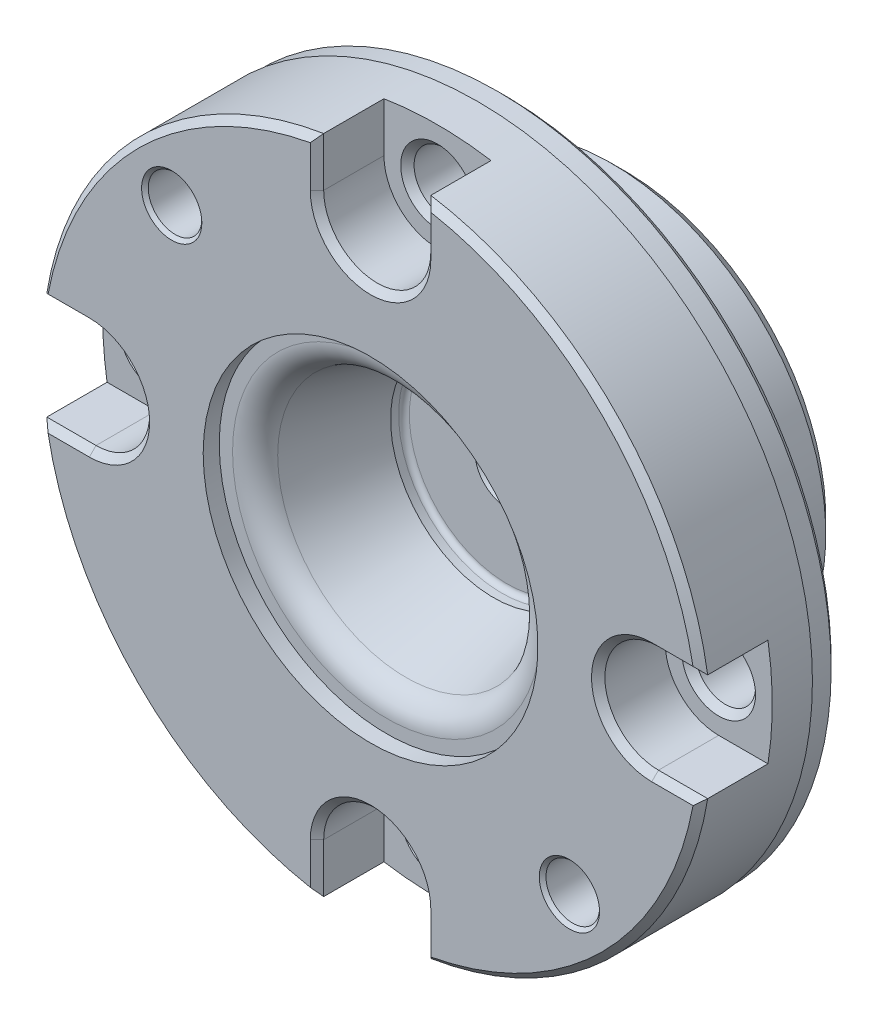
ISO-10303-21;
HEADER;
FILE_DESCRIPTION(('STEP AP214'),'2;1');
FILE_NAME('part.step','',(''),(''),'','','');
FILE_SCHEMA(('AUTOMOTIVE_DESIGN { 1 0 10303 214 1 1 1 1 }'));
ENDSEC;
DATA;
#1=APPLICATION_CONTEXT('core data for automotive mechanical design processes');
#2=APPLICATION_PROTOCOL_DEFINITION('international standard','automotive_design',2000,#1);
#3=PRODUCT_CONTEXT('',#1,'mechanical');
#4=PRODUCT('Part','Part','',(#3));
#5=PRODUCT_RELATED_PRODUCT_CATEGORY('part','',(#4));
#6=PRODUCT_DEFINITION_FORMATION('','',#4);
#7=PRODUCT_DEFINITION_CONTEXT('part definition',#1,'design');
#8=PRODUCT_DEFINITION('design','',#6,#7);
#9=PRODUCT_DEFINITION_SHAPE('','',#8);
#10=(LENGTH_UNIT() NAMED_UNIT(*) SI_UNIT(.MILLI.,.METRE.));
#11=(NAMED_UNIT(*) PLANE_ANGLE_UNIT() SI_UNIT($,.RADIAN.));
#12=(NAMED_UNIT(*) SI_UNIT($,.STERADIAN.) SOLID_ANGLE_UNIT());
#13=UNCERTAINTY_MEASURE_WITH_UNIT(LENGTH_MEASURE(1.E-05),#10,'distance_accuracy_value','');
#14=(GEOMETRIC_REPRESENTATION_CONTEXT(3) GLOBAL_UNCERTAINTY_ASSIGNED_CONTEXT((#13)) GLOBAL_UNIT_ASSIGNED_CONTEXT((#10,
#11,#12)) REPRESENTATION_CONTEXT('',''));
#15=CARTESIAN_POINT('',(0.,0.,0.));
#16=DIRECTION('',(0.,0.,1.));
#17=DIRECTION('',(1.,0.,0.));
#18=AXIS2_PLACEMENT_3D('',#15,#16,#17);
#19=CARTESIAN_POINT('',(3.5,0.,-2.5));
#20=DIRECTION('',(0.,0.,-1.));
#21=DIRECTION('',(-1.,0.,0.));
#22=AXIS2_PLACEMENT_3D('',#19,#20,#21);
#23=PLANE('',#22);
#24=CARTESIAN_POINT('',(0.,0.,-2.5));
#25=DIRECTION('',(0.,0.,-1.));
#26=DIRECTION('',(-1.,0.,0.));
#27=AXIS2_PLACEMENT_3D('',#24,#25,#26);
#28=CIRCLE('',#27,3.9);
#29=CARTESIAN_POINT('',(-3.9,0.,-2.5));
#30=VERTEX_POINT('',#29);
#31=EDGE_CURVE('E516',#30,#30,#28,.F.);
#32=ORIENTED_EDGE('',*,*,#31,.T.);
#33=EDGE_LOOP('',(#32));
#34=FACE_BOUND('',#33,.T.);
#35=CARTESIAN_POINT('',(0.,0.,-2.5));
#36=DIRECTION('',(0.,0.,1.));
#37=DIRECTION('',(1.,0.,0.));
#38=AXIS2_PLACEMENT_3D('',#35,#36,#37);
#39=CIRCLE('',#38,8.);
#40=CARTESIAN_POINT('',(8.,0.,-2.5));
#41=VERTEX_POINT('',#40);
#42=EDGE_CURVE('E492',#41,#41,#39,.T.);
#43=ORIENTED_EDGE('',*,*,#42,.F.);
#44=EDGE_LOOP('',(#43));
#45=FACE_BOUND('',#44,.T.);
#46=ADVANCED_FACE('F15',(#34,#45),#23,.T.);
#47=CARTESIAN_POINT('',(0.,0.,-6.7));
#48=DIRECTION('',(0.,0.,1.));
#49=DIRECTION('',(1.,0.,0.));
#50=AXIS2_PLACEMENT_3D('',#47,#48,#49);
#51=PLANE('',#50);
#52=CARTESIAN_POINT('',(0.,0.,-6.7));
#53=DIRECTION('',(0.,0.,1.));
#54=DIRECTION('',(1.,0.,0.));
#55=AXIS2_PLACEMENT_3D('',#52,#53,#54);
#56=CIRCLE('',#55,3.75);
#57=CARTESIAN_POINT('',(3.75,0.,-6.7));
#58=VERTEX_POINT('',#57);
#59=EDGE_CURVE('E296',#58,#58,#56,.T.);
#60=ORIENTED_EDGE('',*,*,#59,.F.);
#61=EDGE_LOOP('',(#60));
#62=FACE_BOUND('',#61,.T.);
#63=CARTESIAN_POINT('',(0.,0.,-6.7));
#64=DIRECTION('',(0.,0.,1.));
#65=DIRECTION('',(1.,0.,0.));
#66=AXIS2_PLACEMENT_3D('',#63,#64,#65);
#67=CIRCLE('',#66,12.3);
#68=CARTESIAN_POINT('',(12.3,0.,-6.7));
#69=VERTEX_POINT('',#68);
#70=EDGE_CURVE('E521',#69,#69,#67,.T.);
#71=ORIENTED_EDGE('',*,*,#70,.T.);
#72=EDGE_LOOP('',(#71));
#73=FACE_BOUND('',#72,.T.);
#74=ADVANCED_FACE('F987',(#62,#73),#51,.T.);
#75=CARTESIAN_POINT('',(0.,0.,8.8));
#76=DIRECTION('',(0.,0.,1.));
#77=DIRECTION('',(1.,0.,0.));
#78=AXIS2_PLACEMENT_3D('',#75,#76,#77);
#79=CYLINDRICAL_SURFACE('',#78,3.5);
#80=CARTESIAN_POINT('',(0.,0.,-2.9));
#81=DIRECTION('',(0.,0.,-1.));
#82=DIRECTION('',(-1.,0.,0.));
#83=AXIS2_PLACEMENT_3D('',#80,#81,#82);
#84=CIRCLE('',#83,3.5);
#85=CARTESIAN_POINT('',(-3.5,0.,-2.9));
#86=VERTEX_POINT('',#85);
#87=EDGE_CURVE('E517',#86,#86,#84,.T.);
#88=ORIENTED_EDGE('',*,*,#87,.T.);
#89=EDGE_LOOP('',(#88));
#90=FACE_BOUND('',#89,.T.);
#91=CARTESIAN_POINT('',(0.,0.,-10.2));
#92=DIRECTION('',(0.,0.,1.));
#93=DIRECTION('',(1.,0.,0.));
#94=AXIS2_PLACEMENT_3D('',#91,#92,#93);
#95=CIRCLE('',#94,3.5);
#96=CARTESIAN_POINT('',(3.5,0.,-10.2));
#97=VERTEX_POINT('',#96);
#98=EDGE_CURVE('E520',#97,#97,#95,.T.);
#99=ORIENTED_EDGE('',*,*,#98,.T.);
#100=EDGE_LOOP('',(#99));
#101=FACE_BOUND('',#100,.T.);
#102=ADVANCED_FACE('F994',(#90,#101),#79,.T.);
#103=CARTESIAN_POINT('',(0.,0.,-4.7));
#104=DIRECTION('',(0.,0.,-1.));
#105=DIRECTION('',(-1.,0.,0.));
#106=AXIS2_PLACEMENT_3D('',#103,#104,#105);
#107=CONICAL_SURFACE('',#106,10.2,0.785398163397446);
#108=ORIENTED_EDGE('',*,*,#42,.T.);
#109=EDGE_LOOP('',(#108));
#110=FACE_BOUND('',#109,.T.);
#111=CARTESIAN_POINT('',(0.,0.,-4.7));
#112=DIRECTION('',(0.,0.,1.));
#113=DIRECTION('',(1.,0.,0.));
#114=AXIS2_PLACEMENT_3D('',#111,#112,#113);
#115=CIRCLE('',#114,10.2);
#116=CARTESIAN_POINT('',(10.2,0.,-4.7));
#117=VERTEX_POINT('',#116);
#118=EDGE_CURVE('E480',#117,#117,#115,.T.);
#119=ORIENTED_EDGE('',*,*,#118,.F.);
#120=EDGE_LOOP('',(#119));
#121=FACE_BOUND('',#120,.T.);
#122=ADVANCED_FACE('F1001',(#110,#121),#107,.F.);
#123=CARTESIAN_POINT('',(12.5,0.,-4.7));
#124=DIRECTION('',(0.,0.,-1.));
#125=DIRECTION('',(-1.,0.,0.));
#126=AXIS2_PLACEMENT_3D('',#123,#124,#125);
#127=PLANE('',#126);
#128=CARTESIAN_POINT('',(0.,0.,-4.7));
#129=DIRECTION('',(0.,0.,-1.));
#130=DIRECTION('',(-1.,0.,0.));
#131=AXIS2_PLACEMENT_3D('',#128,#129,#130);
#132=CIRCLE('',#131,11.5);
#133=CARTESIAN_POINT('',(-11.5,0.,-4.7));
#134=VERTEX_POINT('',#133);
#135=EDGE_CURVE('E489',#134,#134,#132,.T.);
#136=ORIENTED_EDGE('',*,*,#135,.T.);
#137=EDGE_LOOP('',(#136));
#138=FACE_BOUND('',#137,.T.);
#139=ORIENTED_EDGE('',*,*,#118,.T.);
#140=EDGE_LOOP('',(#139));
#141=FACE_BOUND('',#140,.T.);
#142=ADVANCED_FACE('F1004',(#138,#141),#127,.T.);
#143=CARTESIAN_POINT('',(0.,0.,8.8));
#144=DIRECTION('',(0.,0.,1.));
#145=DIRECTION('',(1.,0.,0.));
#146=AXIS2_PLACEMENT_3D('',#143,#144,#145);
#147=CYLINDRICAL_SURFACE('',#146,3.35);
#148=CARTESIAN_POINT('',(0.,0.,-11.));
#149=DIRECTION('',(0.,0.,-1.));
#150=DIRECTION('',(0.,1.,0.));
#151=AXIS2_PLACEMENT_3D('',#148,#149,#150);
#152=CIRCLE('',#151,3.35);
#153=CARTESIAN_POINT('',(0.,3.35,-11.));
#154=VERTEX_POINT('',#153);
#155=EDGE_CURVE('E476',#154,#154,#152,.T.);
#156=ORIENTED_EDGE('',*,*,#155,.T.);
#157=EDGE_LOOP('',(#156));
#158=FACE_BOUND('',#157,.T.);
#159=CARTESIAN_POINT('',(0.,0.,-11.1));
#160=DIRECTION('',(0.,0.,1.));
#161=DIRECTION('',(1.,0.,0.));
#162=AXIS2_PLACEMENT_3D('',#159,#160,#161);
#163=CIRCLE('',#162,3.35);
#164=CARTESIAN_POINT('',(3.35,0.,-11.1));
#165=VERTEX_POINT('',#164);
#166=EDGE_CURVE('E479',#165,#165,#163,.T.);
#167=ORIENTED_EDGE('',*,*,#166,.T.);
#168=EDGE_LOOP('',(#167));
#169=FACE_BOUND('',#168,.T.);
#170=ADVANCED_FACE('F1008',(#158,#169),#147,.T.);
#171=CARTESIAN_POINT('',(-3.5,0.,-11.1));
#172=DIRECTION('',(0.,0.,1.));
#173=DIRECTION('',(1.,0.,0.));
#174=AXIS2_PLACEMENT_3D('',#171,#172,#173);
#175=PLANE('',#174);
#176=CARTESIAN_POINT('',(0.,0.,-11.1));
#177=DIRECTION('',(0.,0.,1.));
#178=DIRECTION('',(1.,0.,0.));
#179=AXIS2_PLACEMENT_3D('',#176,#177,#178);
#180=CIRCLE('',#179,3.5);
#181=CARTESIAN_POINT('',(3.5,0.,-11.1));
#182=VERTEX_POINT('',#181);
#183=EDGE_CURVE('E485',#182,#182,#180,.T.);
#184=ORIENTED_EDGE('',*,*,#183,.T.);
#185=EDGE_LOOP('',(#184));
#186=FACE_BOUND('',#185,.T.);
#187=ORIENTED_EDGE('',*,*,#166,.F.);
#188=EDGE_LOOP('',(#187));
#189=FACE_BOUND('',#188,.T.);
#190=ADVANCED_FACE('F1012',(#186,#189),#175,.T.);
#191=CARTESIAN_POINT('',(3.5,0.,-12.1));
#192=DIRECTION('',(0.,0.,-1.));
#193=DIRECTION('',(-1.,0.,0.));
#194=AXIS2_PLACEMENT_3D('',#191,#192,#193);
#195=PLANE('',#194);
#196=CARTESIAN_POINT('',(0.,0.,-12.1));
#197=DIRECTION('',(0.,0.,1.));
#198=DIRECTION('',(1.,0.,0.));
#199=AXIS2_PLACEMENT_3D('',#196,#197,#198);
#200=CIRCLE('',#199,2.);
#201=CARTESIAN_POINT('',(2.,0.,-12.1));
#202=VERTEX_POINT('',#201);
#203=EDGE_CURVE('E357',#202,#202,#200,.T.);
#204=ORIENTED_EDGE('',*,*,#203,.T.);
#205=EDGE_LOOP('',(#204));
#206=FACE_BOUND('',#205,.T.);
#207=CARTESIAN_POINT('',(0.,0.,-12.1));
#208=DIRECTION('',(0.,0.,-1.));
#209=DIRECTION('',(-1.,0.,0.));
#210=AXIS2_PLACEMENT_3D('',#207,#208,#209);
#211=CIRCLE('',#210,3.2);
#212=CARTESIAN_POINT('',(-3.2,0.,-12.1));
#213=VERTEX_POINT('',#212);
#214=EDGE_CURVE('E481',#213,#213,#211,.T.);
#215=ORIENTED_EDGE('',*,*,#214,.T.);
#216=EDGE_LOOP('',(#215));
#217=FACE_BOUND('',#216,.T.);
#218=ADVANCED_FACE('F1016',(#206,#217),#195,.T.);
#219=CARTESIAN_POINT('',(0.,0.,-11.8));
#220=DIRECTION('',(0.,0.,-1.));
#221=DIRECTION('',(-1.,0.,0.));
#222=AXIS2_PLACEMENT_3D('',#219,#220,#221);
#223=CIRCLE('',#222,3.5);
#224=CARTESIAN_POINT('',(-3.5,0.,-11.8));
#225=VERTEX_POINT('',#224);
#226=EDGE_CURVE('E484',#225,#225,#223,.F.);
#227=ORIENTED_EDGE('',*,*,#226,.T.);
#228=EDGE_LOOP('',(#227));
#229=FACE_BOUND('',#228,.T.);
#230=ORIENTED_EDGE('',*,*,#183,.F.);
#231=EDGE_LOOP('',(#230));
#232=FACE_BOUND('',#231,.T.);
#233=ADVANCED_FACE('F1703',(#229,#232),#79,.T.);
#234=CARTESIAN_POINT('',(7.70603691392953,0.,-0.199999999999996));
#235=DIRECTION('',(0.,0.,1.));
#236=DIRECTION('',(1.,0.,0.));
#237=AXIS2_PLACEMENT_3D('',#234,#235,#236);
#238=PLANE('',#237);
#239=CARTESIAN_POINT('',(0.,0.,-0.199999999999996));
#240=DIRECTION('',(0.,0.,1.));
#241=DIRECTION('',(1.,0.,0.));
#242=AXIS2_PLACEMENT_3D('',#239,#240,#241);
#243=CIRCLE('',#242,7.30603691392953);
#244=CARTESIAN_POINT('',(7.30603691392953,0.,-0.199999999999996));
#245=VERTEX_POINT('',#244);
#246=EDGE_CURVE('E488',#245,#245,#243,.T.);
#247=ORIENTED_EDGE('',*,*,#246,.T.);
#248=EDGE_LOOP('',(#247));
#249=FACE_BOUND('',#248,.T.);
#250=CARTESIAN_POINT('',(0.,0.,-0.199999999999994));
#251=DIRECTION('',(0.,0.,1.));
#252=DIRECTION('',(1.,0.,0.));
#253=AXIS2_PLACEMENT_3D('',#250,#251,#252);
#254=CIRCLE('',#253,2.4);
#255=CARTESIAN_POINT('',(2.4,0.,-0.199999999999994));
#256=VERTEX_POINT('',#255);
#257=EDGE_CURVE('E345',#256,#256,#254,.T.);
#258=ORIENTED_EDGE('',*,*,#257,.F.);
#259=EDGE_LOOP('',(#258));
#260=FACE_BOUND('',#259,.T.);
#261=ADVANCED_FACE('F1741',(#249,#260),#238,.T.);
#262=CARTESIAN_POINT('',(0.,0.,8.8));
#263=DIRECTION('',(0.,0.,1.));
#264=DIRECTION('',(1.,0.,0.));
#265=AXIS2_PLACEMENT_3D('',#262,#263,#264);
#266=CYLINDRICAL_SURFACE('',#265,7.70603691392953);
#267=CARTESIAN_POINT('',(0.,0.,0.200000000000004));
#268=DIRECTION('',(0.,0.,1.));
#269=DIRECTION('',(1.,0.,0.));
#270=AXIS2_PLACEMENT_3D('',#267,#268,#269);
#271=CIRCLE('',#270,7.70603691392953);
#272=CARTESIAN_POINT('',(7.70603691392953,0.,0.200000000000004));
#273=VERTEX_POINT('',#272);
#274=EDGE_CURVE('E524',#273,#273,#271,.F.);
#275=ORIENTED_EDGE('',*,*,#274,.T.);
#276=EDGE_LOOP('',(#275));
#277=FACE_BOUND('',#276,.T.);
#278=CARTESIAN_POINT('',(0.,0.,0.8));
#279=DIRECTION('',(0.,0.,1.));
#280=DIRECTION('',(1.,0.,0.));
#281=AXIS2_PLACEMENT_3D('',#278,#279,#280);
#282=CIRCLE('',#281,7.70603691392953);
#283=CARTESIAN_POINT('',(7.70603691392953,0.,0.8));
#284=VERTEX_POINT('',#283);
#285=EDGE_CURVE('E502',#284,#284,#282,.T.);
#286=ORIENTED_EDGE('',*,*,#285,.T.);
#287=EDGE_LOOP('',(#286));
#288=FACE_BOUND('',#287,.T.);
#289=ADVANCED_FACE('F1755',(#277,#288),#266,.F.);
#290=CARTESIAN_POINT('',(0.,0.,0.8));
#291=DIRECTION('',(0.,0.,1.));
#292=DIRECTION('',(1.,0.,0.));
#293=AXIS2_PLACEMENT_3D('',#290,#291,#292);
#294=CONICAL_SURFACE('',#293,7.70603691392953,0.279252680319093);
#295=CARTESIAN_POINT('',(0.,0.,7.35127471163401));
#296=DIRECTION('',(0.,0.,-1.));
#297=DIRECTION('',(-1.,0.,0.));
#298=AXIS2_PLACEMENT_3D('',#295,#296,#297);
#299=CIRCLE('',#298,9.58458470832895);
#300=CARTESIAN_POINT('',(-9.58458470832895,0.,7.35127471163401));
#301=VERTEX_POINT('',#300);
#302=EDGE_CURVE('E499',#301,#301,#299,.F.);
#303=ORIENTED_EDGE('',*,*,#302,.T.);
#304=EDGE_LOOP('',(#303));
#305=FACE_BOUND('',#304,.T.);
#306=ORIENTED_EDGE('',*,*,#285,.F.);
#307=EDGE_LOOP('',(#306));
#308=FACE_BOUND('',#307,.T.);
#309=ADVANCED_FACE('F1765',(#305,#308),#294,.F.);
#310=CARTESIAN_POINT('',(12.5,0.,8.8));
#311=DIRECTION('',(0.,0.,1.));
#312=DIRECTION('',(1.,0.,0.));
#313=AXIS2_PLACEMENT_3D('',#310,#311,#312);
#314=PLANE('',#313);
#315=CARTESIAN_POINT('',(0.,0.,8.8));
#316=DIRECTION('',(0.,0.,1.));
#317=DIRECTION('',(1.,0.,0.));
#318=AXIS2_PLACEMENT_3D('',#315,#316,#317);
#319=CIRCLE('',#318,11.5071081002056);
#320=CARTESIAN_POINT('',(11.5071081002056,0.,8.8));
#321=VERTEX_POINT('',#320);
#322=EDGE_CURVE('E496',#321,#321,#319,.F.);
#323=ORIENTED_EDGE('',*,*,#322,.T.);
#324=EDGE_LOOP('',(#323));
#325=FACE_BOUND('',#324,.T.);
#326=CARTESIAN_POINT('',(0.,0.,8.8));
#327=DIRECTION('',(0.,0.,1.));
#328=DIRECTION('',(1.,0.,0.));
#329=AXIS2_PLACEMENT_3D('',#326,#327,#328);
#330=CIRCLE('',#329,12.5);
#331=CARTESIAN_POINT('',(12.5,0.,8.8));
#332=VERTEX_POINT('',#331);
#333=EDGE_CURVE('E495',#332,#332,#330,.F.);
#334=ORIENTED_EDGE('',*,*,#333,.F.);
#335=EDGE_LOOP('',(#334));
#336=FACE_BOUND('',#335,.T.);
#337=ADVANCED_FACE('F1037',(#325,#336),#314,.T.);
#338=CARTESIAN_POINT('',(0.,0.,-0.199999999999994));
#339=DIRECTION('',(0.,0.,1.));
#340=DIRECTION('',(1.,0.,0.));
#341=AXIS2_PLACEMENT_3D('',#338,#339,#340);
#342=CONICAL_SURFACE('',#341,2.4,0.785398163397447);
#343=CARTESIAN_POINT('',(0.,0.,-0.6));
#344=DIRECTION('',(0.,0.,1.));
#345=DIRECTION('',(1.,0.,0.));
#346=AXIS2_PLACEMENT_3D('',#343,#344,#345);
#347=CIRCLE('',#346,2.);
#348=CARTESIAN_POINT('',(2.,0.,-0.6));
#349=VERTEX_POINT('',#348);
#350=EDGE_CURVE('E19',#349,#349,#347,.F.);
#351=ORIENTED_EDGE('',*,*,#350,.T.);
#352=EDGE_LOOP('',(#351));
#353=FACE_BOUND('',#352,.T.);
#354=ORIENTED_EDGE('',*,*,#257,.T.);
#355=EDGE_LOOP('',(#354));
#356=FACE_BOUND('',#355,.T.);
#357=ADVANCED_FACE('F1033',(#353,#356),#342,.F.);
#358=CARTESIAN_POINT('',(0.,0.,0.200000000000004));
#359=DIRECTION('',(0.,0.,1.));
#360=DIRECTION('',(1.,0.,0.));
#361=AXIS2_PLACEMENT_3D('',#358,#359,#360);
#362=TOROIDAL_SURFACE('',#361,7.30603691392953,0.4);
#363=ORIENTED_EDGE('',*,*,#274,.F.);
#364=EDGE_LOOP('',(#363));
#365=FACE_BOUND('',#364,.T.);
#366=ORIENTED_EDGE('',*,*,#246,.F.);
#367=EDGE_LOOP('',(#366));
#368=FACE_BOUND('',#367,.T.);
#369=ADVANCED_FACE('F1036',(#365,#368),#362,.F.);
#370=CARTESIAN_POINT('',(0.,0.,-2.9));
#371=DIRECTION('',(0.,0.,-1.));
#372=DIRECTION('',(-1.,0.,0.));
#373=AXIS2_PLACEMENT_3D('',#370,#371,#372);
#374=TOROIDAL_SURFACE('',#373,3.9,0.4);
#375=ORIENTED_EDGE('',*,*,#87,.F.);
#376=EDGE_LOOP('',(#375));
#377=FACE_BOUND('',#376,.T.);
#378=ORIENTED_EDGE('',*,*,#31,.F.);
#379=EDGE_LOOP('',(#378));
#380=FACE_BOUND('',#379,.T.);
#381=ADVANCED_FACE('F1713',(#377,#380),#374,.F.);
#382=CARTESIAN_POINT('',(0.,0.,6.8));
#383=DIRECTION('',(0.,0.,1.));
#384=DIRECTION('',(1.,0.,0.));
#385=AXIS2_PLACEMENT_3D('',#382,#383,#384);
#386=TOROIDAL_SURFACE('',#385,11.5071081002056,2.);
#387=ORIENTED_EDGE('',*,*,#322,.F.);
#388=EDGE_LOOP('',(#387));
#389=FACE_BOUND('',#388,.T.);
#390=ORIENTED_EDGE('',*,*,#302,.F.);
#391=EDGE_LOOP('',(#390));
#392=FACE_BOUND('',#391,.T.);
#393=ADVANCED_FACE('F1707',(#389,#392),#386,.T.);
#394=CARTESIAN_POINT('',(0.,0.,-3.7));
#395=DIRECTION('',(0.,0.,-1.));
#396=DIRECTION('',(-1.,0.,0.));
#397=AXIS2_PLACEMENT_3D('',#394,#395,#396);
#398=TOROIDAL_SURFACE('',#397,11.5,1.);
#399=ORIENTED_EDGE('',*,*,#135,.F.);
#400=EDGE_LOOP('',(#399));
#401=FACE_BOUND('',#400,.T.);
#402=CARTESIAN_POINT('',(0.,0.,-3.7));
#403=DIRECTION('',(0.,0.,-1.));
#404=DIRECTION('',(-1.,0.,0.));
#405=AXIS2_PLACEMENT_3D('',#402,#403,#404);
#406=CIRCLE('',#405,12.5);
#407=CARTESIAN_POINT('',(-12.5,0.,-3.7));
#408=VERTEX_POINT('',#407);
#409=EDGE_CURVE('E445',#408,#408,#406,.F.);
#410=ORIENTED_EDGE('',*,*,#409,.F.);
#411=EDGE_LOOP('',(#410));
#412=FACE_BOUND('',#411,.T.);
#413=ADVANCED_FACE('F1712',(#401,#412),#398,.T.);
#414=CARTESIAN_POINT('',(0.,0.,-11.8));
#415=DIRECTION('',(0.,0.,1.));
#416=DIRECTION('',(1.,0.,0.));
#417=AXIS2_PLACEMENT_3D('',#414,#415,#416);
#418=CONICAL_SURFACE('',#417,3.5,0.785398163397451);
#419=ORIENTED_EDGE('',*,*,#214,.F.);
#420=EDGE_LOOP('',(#419));
#421=FACE_BOUND('',#420,.T.);
#422=ORIENTED_EDGE('',*,*,#226,.F.);
#423=EDGE_LOOP('',(#422));
#424=FACE_BOUND('',#423,.T.);
#425=ADVANCED_FACE('F1040',(#421,#424),#418,.T.);
#426=CARTESIAN_POINT('',(0.,0.,-6.3));
#427=DIRECTION('',(0.,0.,1.));
#428=DIRECTION('',(1.,0.,0.));
#429=AXIS2_PLACEMENT_3D('',#426,#427,#428);
#430=TOROIDAL_SURFACE('',#429,12.3,0.4);
#431=CARTESIAN_POINT('',(0.,0.,-6.3));
#432=DIRECTION('',(0.,0.,1.));
#433=DIRECTION('',(1.,0.,0.));
#434=AXIS2_PLACEMENT_3D('',#431,#432,#433);
#435=CIRCLE('',#434,12.7);
#436=CARTESIAN_POINT('',(12.7,0.,-6.3));
#437=VERTEX_POINT('',#436);
#438=EDGE_CURVE('E341',#437,#437,#435,.F.);
#439=ORIENTED_EDGE('',*,*,#438,.F.);
#440=EDGE_LOOP('',(#439));
#441=FACE_BOUND('',#440,.T.);
#442=ORIENTED_EDGE('',*,*,#70,.F.);
#443=EDGE_LOOP('',(#442));
#444=FACE_BOUND('',#443,.T.);
#445=ADVANCED_FACE('F1038',(#441,#444),#430,.F.);
#446=CARTESIAN_POINT('',(-12.5,0.,-4.7));
#447=DIRECTION('',(0.,0.,-1.));
#448=DIRECTION('',(-1.,0.,0.));
#449=AXIS2_PLACEMENT_3D('',#446,#447,#448);
#450=PLANE('',#449);
#451=CARTESIAN_POINT('',(0.,0.,-4.7));
#452=DIRECTION('',(0.,0.,1.));
#453=DIRECTION('',(1.,0.,0.));
#454=AXIS2_PLACEMENT_3D('',#451,#452,#453);
#455=CIRCLE('',#454,12.5);
#456=CARTESIAN_POINT('',(12.5,0.,-4.7));
#457=VERTEX_POINT('',#456);
#458=EDGE_CURVE('E342',#457,#457,#455,.T.);
#459=ORIENTED_EDGE('',*,*,#458,.T.);
#460=EDGE_LOOP('',(#459));
#461=FACE_BOUND('',#460,.T.);
#462=CARTESIAN_POINT('',(0.,0.,-4.7));
#463=DIRECTION('',(0.,0.,1.));
#464=DIRECTION('',(1.,0.,0.));
#465=AXIS2_PLACEMENT_3D('',#462,#463,#464);
#466=CIRCLE('',#465,12.7);
#467=CARTESIAN_POINT('',(12.7,0.,-4.7));
#468=VERTEX_POINT('',#467);
#469=EDGE_CURVE('E337',#468,#468,#466,.T.);
#470=ORIENTED_EDGE('',*,*,#469,.F.);
#471=EDGE_LOOP('',(#470));
#472=FACE_BOUND('',#471,.T.);
#473=ADVANCED_FACE('F17',(#461,#472),#450,.T.);
#474=CARTESIAN_POINT('',(0.,0.,0.));
#475=DIRECTION('',(0.,0.,1.));
#476=DIRECTION('',(1.,0.,0.));
#477=AXIS2_PLACEMENT_3D('',#474,#475,#476);
#478=CYLINDRICAL_SURFACE('',#477,12.7);
#479=ORIENTED_EDGE('',*,*,#438,.T.);
#480=EDGE_LOOP('',(#479));
#481=FACE_BOUND('',#480,.T.);
#482=ORIENTED_EDGE('',*,*,#469,.T.);
#483=EDGE_LOOP('',(#482));
#484=FACE_BOUND('',#483,.T.);
#485=ADVANCED_FACE('F1043',(#481,#484),#478,.F.);
#486=CARTESIAN_POINT('',(0.,0.,-9.));
#487=DIRECTION('',(0.,0.,1.));
#488=DIRECTION('',(1.,0.,0.));
#489=AXIS2_PLACEMENT_3D('',#486,#487,#488);
#490=CONICAL_SURFACE('',#489,15.,0.785398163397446);
#491=CARTESIAN_POINT('',(0.,0.,-8.));
#492=DIRECTION('',(0.,0.,-1.));
#493=DIRECTION('',(-1.,0.,0.));
#494=AXIS2_PLACEMENT_3D('',#491,#492,#493);
#495=CIRCLE('',#494,16.);
#496=CARTESIAN_POINT('',(-16.,0.,-8.));
#497=VERTEX_POINT('',#496);
#498=EDGE_CURVE('E328',#497,#497,#495,.F.);
#499=ORIENTED_EDGE('',*,*,#498,.F.);
#500=EDGE_LOOP('',(#499));
#501=FACE_BOUND('',#500,.T.);
#502=CARTESIAN_POINT('',(0.,0.,-9.));
#503=DIRECTION('',(0.,0.,-1.));
#504=DIRECTION('',(-1.,0.,0.));
#505=AXIS2_PLACEMENT_3D('',#502,#503,#504);
#506=CIRCLE('',#505,15.);
#507=CARTESIAN_POINT('',(-15.,0.,-9.));
#508=VERTEX_POINT('',#507);
#509=EDGE_CURVE('E556',#508,#508,#506,.T.);
#510=ORIENTED_EDGE('',*,*,#509,.F.);
#511=EDGE_LOOP('',(#510));
#512=FACE_BOUND('',#511,.T.);
#513=ADVANCED_FACE('F692',(#501,#512),#490,.T.);
#514=CARTESIAN_POINT('',(-21.,-4.,9.5));
#515=DIRECTION('',(0.,0.707106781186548,0.707106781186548));
#516=DIRECTION('',(0.,-0.707106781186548,0.707106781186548));
#517=AXIS2_PLACEMENT_3D('',#514,#515,#516);
#518=PLANE('',#517);
#519=CARTESIAN_POINT('',(-24.0831891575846,-4.5,10.));
#520=CARTESIAN_POINT('',(-24.1830199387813,-4.41708777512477,9.91708777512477));
#521=CARTESIAN_POINT('',(-24.2824966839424,-4.33396499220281,9.83396499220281));
#522=CARTESIAN_POINT('',(-24.4807420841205,-4.16729832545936,9.66729832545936));
#523=CARTESIAN_POINT('',(-24.5795107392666,-4.08375444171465,9.58375444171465));
#524=CARTESIAN_POINT('',(-24.6779253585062,-4.,9.5));
#525=B_SPLINE_CURVE_WITH_KNOTS('',3,(#519,#520,#521,#522,#523,#524),.UNSPECIFIED.,.F.,.F.,(4,2,
4),(0.,0.461984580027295,0.923969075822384),.UNSPECIFIED.);
#526=CARTESIAN_POINT('',(-24.6779253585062,-4.,9.5));
#527=VERTEX_POINT('',#526);
#528=CARTESIAN_POINT('',(-24.0831891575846,-4.5,10.));
#529=VERTEX_POINT('',#528);
#530=EDGE_CURVE('E340',#527,#529,#525,.F.);
#531=ORIENTED_EDGE('',*,*,#530,.T.);
#532=DIRECTION('',(-1.,0.,0.));
#533=VECTOR('',#532,1.);
#534=CARTESIAN_POINT('',(-24.6779253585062,-4.5,10.));
#535=LINE('',#534,#533);
#536=CARTESIAN_POINT('',(-21.,-4.5,10.));
#537=VERTEX_POINT('',#536);
#538=EDGE_CURVE('E756',#537,#529,#535,.T.);
#539=ORIENTED_EDGE('',*,*,#538,.F.);
#540=DIRECTION('',(0.,0.707106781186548,-0.707106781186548));
#541=VECTOR('',#540,1.);
#542=CARTESIAN_POINT('',(-21.,-4.5,10.));
#543=LINE('',#542,#541);
#544=CARTESIAN_POINT('',(-21.,-4.,9.5));
#545=VERTEX_POINT('',#544);
#546=EDGE_CURVE('E699',#537,#545,#543,.T.);
#547=ORIENTED_EDGE('',*,*,#546,.T.);
#548=DIRECTION('',(1.,0.,0.));
#549=VECTOR('',#548,1.);
#550=CARTESIAN_POINT('',(-21.,-4.,9.5));
#551=LINE('',#550,#549);
#552=EDGE_CURVE('E772',#527,#545,#551,.T.);
#553=ORIENTED_EDGE('',*,*,#552,.F.);
#554=EDGE_LOOP('',(#531,#539,#547,#553));
#555=FACE_BOUND('',#554,.T.);
#556=ADVANCED_FACE('F688',(#555),#518,.T.);
#557=CARTESIAN_POINT('',(-21.,0.,9.5));
#558=DIRECTION('',(0.,0.,1.));
#559=DIRECTION('',(1.,0.,0.));
#560=AXIS2_PLACEMENT_3D('',#557,#558,#559);
#561=CONICAL_SURFACE('',#560,4.,0.785398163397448);
#562=DIRECTION('',(0.,-0.707106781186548,-0.707106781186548));
#563=VECTOR('',#562,1.);
#564=CARTESIAN_POINT('',(-21.,4.5,10.));
#565=LINE('',#564,#563);
#566=CARTESIAN_POINT('',(-21.,4.5,10.));
#567=VERTEX_POINT('',#566);
#568=CARTESIAN_POINT('',(-21.,4.,9.5));
#569=VERTEX_POINT('',#568);
#570=EDGE_CURVE('E677',#567,#569,#565,.T.);
#571=ORIENTED_EDGE('',*,*,#570,.T.);
#572=CARTESIAN_POINT('',(-21.,0.,9.5));
#573=DIRECTION('',(0.,0.,1.));
#574=DIRECTION('',(1.,0.,0.));
#575=AXIS2_PLACEMENT_3D('',#572,#573,#574);
#576=CIRCLE('',#575,4.);
#577=EDGE_CURVE('E559',#545,#569,#576,.T.);
#578=ORIENTED_EDGE('',*,*,#577,.F.);
#579=ORIENTED_EDGE('',*,*,#546,.F.);
#580=CARTESIAN_POINT('',(-21.,0.,10.));
#581=DIRECTION('',(0.,0.,1.));
#582=DIRECTION('',(1.,0.,0.));
#583=AXIS2_PLACEMENT_3D('',#580,#581,#582);
#584=CIRCLE('',#583,4.5);
#585=EDGE_CURVE('E761',#567,#537,#584,.F.);
#586=ORIENTED_EDGE('',*,*,#585,.F.);
#587=EDGE_LOOP('',(#571,#578,#579,#586));
#588=FACE_BOUND('',#587,.T.);
#589=ADVANCED_FACE('F686',(#588),#561,.F.);
#590=CARTESIAN_POINT('',(0.,0.,9.5));
#591=DIRECTION('',(0.,0.,-1.));
#592=DIRECTION('',(-1.,0.,0.));
#593=AXIS2_PLACEMENT_3D('',#590,#591,#592);
#594=CONICAL_SURFACE('',#593,25.,0.785398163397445);
#595=CARTESIAN_POINT('',(-3.99999999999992,-24.6779253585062,9.5));
#596=CARTESIAN_POINT('',(-4.08375444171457,-24.5795107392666,9.58375444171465));
#597=CARTESIAN_POINT('',(-4.16729832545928,-24.4807420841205,9.66729832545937));
#598=CARTESIAN_POINT('',(-4.33396499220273,-24.2824966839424,9.83396499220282));
#599=CARTESIAN_POINT('',(-4.41708777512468,-24.1830199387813,9.91708777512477));
#600=CARTESIAN_POINT('',(-4.4999999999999,-24.0831891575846,10.));
#601=B_SPLINE_CURVE_WITH_KNOTS('',3,(#595,#596,#597,#598,#599,#600),.UNSPECIFIED.,.F.,.F.,(4,2,
4),(0.,0.461984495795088,0.923969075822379),.UNSPECIFIED.);
#602=CARTESIAN_POINT('',(-3.99999999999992,-24.6779253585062,9.5));
#603=VERTEX_POINT('',#602);
#604=CARTESIAN_POINT('',(-4.4999999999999,-24.0831891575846,10.));
#605=VERTEX_POINT('',#604);
#606=EDGE_CURVE('E669',#603,#605,#601,.T.);
#607=ORIENTED_EDGE('',*,*,#606,.T.);
#608=CARTESIAN_POINT('',(0.,0.,10.));
#609=DIRECTION('',(0.,0.,1.));
#610=DIRECTION('',(1.,0.,0.));
#611=AXIS2_PLACEMENT_3D('',#608,#609,#610);
#612=CIRCLE('',#611,24.5);
#613=EDGE_CURVE('E752',#529,#605,#612,.T.);
#614=ORIENTED_EDGE('',*,*,#613,.F.);
#615=ORIENTED_EDGE('',*,*,#530,.F.);
#616=CARTESIAN_POINT('',(0.,0.,9.5));
#617=DIRECTION('',(0.,0.,1.));
#618=DIRECTION('',(1.,0.,0.));
#619=AXIS2_PLACEMENT_3D('',#616,#617,#618);
#620=CIRCLE('',#619,25.);
#621=EDGE_CURVE('E701',#603,#527,#620,.F.);
#622=ORIENTED_EDGE('',*,*,#621,.F.);
#623=EDGE_LOOP('',(#607,#614,#615,#622));
#624=FACE_BOUND('',#623,.T.);
#625=ADVANCED_FACE('F660',(#624),#594,.T.);
#626=CARTESIAN_POINT('',(-21.,4.,9.5));
#627=DIRECTION('',(0.,-0.707106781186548,0.707106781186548));
#628=DIRECTION('',(0.,-0.707106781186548,-0.707106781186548));
#629=AXIS2_PLACEMENT_3D('',#626,#627,#628);
#630=PLANE('',#629);
#631=CARTESIAN_POINT('',(-24.6779253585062,4.,9.5));
#632=CARTESIAN_POINT('',(-24.5795107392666,4.08375444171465,9.58375444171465));
#633=CARTESIAN_POINT('',(-24.4807420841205,4.16729832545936,9.66729832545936));
#634=CARTESIAN_POINT('',(-24.2824966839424,4.33396499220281,9.83396499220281));
#635=CARTESIAN_POINT('',(-24.1830199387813,4.41708777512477,9.91708777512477));
#636=CARTESIAN_POINT('',(-24.0831891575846,4.5,10.));
#637=B_SPLINE_CURVE_WITH_KNOTS('',3,(#631,#632,#633,#634,#635,#636),.UNSPECIFIED.,.F.,.F.,(4,2,
4),(0.,0.46198449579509,0.923969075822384),.UNSPECIFIED.);
#638=CARTESIAN_POINT('',(-24.0831891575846,4.5,10.));
#639=VERTEX_POINT('',#638);
#640=CARTESIAN_POINT('',(-24.6779253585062,4.,9.5));
#641=VERTEX_POINT('',#640);
#642=EDGE_CURVE('E662',#639,#641,#637,.F.);
#643=ORIENTED_EDGE('',*,*,#642,.T.);
#644=DIRECTION('',(-1.,0.,0.));
#645=VECTOR('',#644,1.);
#646=CARTESIAN_POINT('',(-24.6779253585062,4.,9.5));
#647=LINE('',#646,#645);
#648=EDGE_CURVE('E736',#569,#641,#647,.T.);
#649=ORIENTED_EDGE('',*,*,#648,.F.);
#650=ORIENTED_EDGE('',*,*,#570,.F.);
#651=DIRECTION('',(1.,0.,0.));
#652=VECTOR('',#651,1.);
#653=CARTESIAN_POINT('',(-21.,4.5,10.));
#654=LINE('',#653,#652);
#655=EDGE_CURVE('E763',#639,#567,#654,.T.);
#656=ORIENTED_EDGE('',*,*,#655,.F.);
#657=EDGE_LOOP('',(#643,#649,#650,#656));
#658=FACE_BOUND('',#657,.T.);
#659=ADVANCED_FACE('F656',(#658),#630,.T.);
#660=CARTESIAN_POINT('',(-3.99999999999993,-21.,9.5));
#661=DIRECTION('',(0.707106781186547,0.,0.707106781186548));
#662=DIRECTION('',(0.707106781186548,0.,-0.707106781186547));
#663=AXIS2_PLACEMENT_3D('',#660,#661,#662);
#664=PLANE('',#663);
#665=DIRECTION('',(-0.707106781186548,0.,0.707106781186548));
#666=VECTOR('',#665,1.);
#667=CARTESIAN_POINT('',(-3.99999999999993,-21.,9.5));
#668=LINE('',#667,#666);
#669=CARTESIAN_POINT('',(-3.99999999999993,-21.,9.5));
#670=VERTEX_POINT('',#669);
#671=CARTESIAN_POINT('',(-4.49999999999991,-21.,10.));
#672=VERTEX_POINT('',#671);
#673=EDGE_CURVE('E646',#670,#672,#668,.T.);
#674=ORIENTED_EDGE('',*,*,#673,.T.);
#675=DIRECTION('',(0.,1.,0.));
#676=VECTOR('',#675,1.);
#677=CARTESIAN_POINT('',(-4.49999999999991,-21.,10.));
#678=LINE('',#677,#676);
#679=EDGE_CURVE('E746',#605,#672,#678,.T.);
#680=ORIENTED_EDGE('',*,*,#679,.F.);
#681=ORIENTED_EDGE('',*,*,#606,.F.);
#682=DIRECTION('',(0.,-1.,0.));
#683=VECTOR('',#682,1.);
#684=CARTESIAN_POINT('',(-3.99999999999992,-24.6779253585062,9.5));
#685=LINE('',#684,#683);
#686=EDGE_CURVE('E728',#670,#603,#685,.T.);
#687=ORIENTED_EDGE('',*,*,#686,.F.);
#688=EDGE_LOOP('',(#674,#680,#681,#687));
#689=FACE_BOUND('',#688,.T.);
#690=ADVANCED_FACE('F659',(#689),#664,.T.);
#691=CARTESIAN_POINT('',(0.,0.,9.5));
#692=DIRECTION('',(0.,0.,-1.));
#693=DIRECTION('',(-1.,0.,0.));
#694=AXIS2_PLACEMENT_3D('',#691,#692,#693);
#695=CONICAL_SURFACE('',#694,25.,0.785398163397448);
#696=CARTESIAN_POINT('',(-4.50000000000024,24.0831891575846,10.));
#697=CARTESIAN_POINT('',(-4.41708777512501,24.1830199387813,9.91708777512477));
#698=CARTESIAN_POINT('',(-4.33396499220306,24.2824966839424,9.83396499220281));
#699=CARTESIAN_POINT('',(-4.16729832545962,24.4807420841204,9.66729832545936));
#700=CARTESIAN_POINT('',(-4.08375444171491,24.5795107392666,9.58375444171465));
#701=CARTESIAN_POINT('',(-4.00000000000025,24.6779253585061,9.5));
#702=B_SPLINE_CURVE_WITH_KNOTS('',3,(#696,#697,#698,#699,#700,#701),.UNSPECIFIED.,.F.,.F.,(4,2,
4),(0.,0.461984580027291,0.923969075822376),.UNSPECIFIED.);
#703=CARTESIAN_POINT('',(-4.50000000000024,24.0831891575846,10.));
#704=VERTEX_POINT('',#703);
#705=CARTESIAN_POINT('',(-4.00000000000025,24.6779253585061,9.5));
#706=VERTEX_POINT('',#705);
#707=EDGE_CURVE('E637',#704,#706,#702,.T.);
#708=ORIENTED_EDGE('',*,*,#707,.T.);
#709=CARTESIAN_POINT('',(0.,0.,9.5));
#710=DIRECTION('',(0.,0.,1.));
#711=DIRECTION('',(1.,0.,0.));
#712=AXIS2_PLACEMENT_3D('',#709,#710,#711);
#713=CIRCLE('',#712,25.);
#714=EDGE_CURVE('E276',#641,#706,#713,.F.);
#715=ORIENTED_EDGE('',*,*,#714,.F.);
#716=ORIENTED_EDGE('',*,*,#642,.F.);
#717=CARTESIAN_POINT('',(0.,0.,10.));
#718=DIRECTION('',(0.,0.,1.));
#719=DIRECTION('',(1.,0.,0.));
#720=AXIS2_PLACEMENT_3D('',#717,#718,#719);
#721=CIRCLE('',#720,24.5);
#722=EDGE_CURVE('E769',#704,#639,#721,.T.);
#723=ORIENTED_EDGE('',*,*,#722,.F.);
#724=EDGE_LOOP('',(#708,#715,#716,#723));
#725=FACE_BOUND('',#724,.T.);
#726=ADVANCED_FACE('F648',(#725),#695,.T.);
#727=CARTESIAN_POINT('',(0.,-21.,9.5));
#728=DIRECTION('',(0.,0.,1.));
#729=DIRECTION('',(1.,0.,0.));
#730=AXIS2_PLACEMENT_3D('',#727,#728,#729);
#731=CONICAL_SURFACE('',#730,4.,0.785398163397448);
#732=DIRECTION('',(0.707106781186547,0.,0.707106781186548));
#733=VECTOR('',#732,1.);
#734=CARTESIAN_POINT('',(4.00000000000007,-21.,9.5));
#735=LINE('',#734,#733);
#736=CARTESIAN_POINT('',(4.00000000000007,-21.,9.5));
#737=VERTEX_POINT('',#736);
#738=CARTESIAN_POINT('',(4.50000000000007,-21.,10.));
#739=VERTEX_POINT('',#738);
#740=EDGE_CURVE('E634',#737,#739,#735,.T.);
#741=ORIENTED_EDGE('',*,*,#740,.T.);
#742=CARTESIAN_POINT('',(0.,-21.,10.));
#743=DIRECTION('',(0.,0.,1.));
#744=DIRECTION('',(1.,0.,0.));
#745=AXIS2_PLACEMENT_3D('',#742,#743,#744);
#746=CIRCLE('',#745,4.5);
#747=EDGE_CURVE('E744',#672,#739,#746,.F.);
#748=ORIENTED_EDGE('',*,*,#747,.F.);
#749=ORIENTED_EDGE('',*,*,#673,.F.);
#750=CARTESIAN_POINT('',(0.,-21.,9.5));
#751=DIRECTION('',(0.,0.,1.));
#752=DIRECTION('',(1.,0.,0.));
#753=AXIS2_PLACEMENT_3D('',#750,#751,#752);
#754=CIRCLE('',#753,4.);
#755=EDGE_CURVE('E724',#737,#670,#754,.T.);
#756=ORIENTED_EDGE('',*,*,#755,.F.);
#757=EDGE_LOOP('',(#741,#748,#749,#756));
#758=FACE_BOUND('',#757,.T.);
#759=ADVANCED_FACE('F654',(#758),#731,.F.);
#760=CARTESIAN_POINT('',(-4.00000000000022,21.,9.5));
#761=DIRECTION('',(0.707106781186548,0.,0.707106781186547));
#762=DIRECTION('',(0.707106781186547,0.,-0.707106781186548));
#763=AXIS2_PLACEMENT_3D('',#760,#761,#762);
#764=PLANE('',#763);
#765=DIRECTION('',(0.707106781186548,0.,-0.707106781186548));
#766=VECTOR('',#765,1.);
#767=CARTESIAN_POINT('',(-4.50000000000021,21.,10.));
#768=LINE('',#767,#766);
#769=CARTESIAN_POINT('',(-4.50000000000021,21.,10.));
#770=VERTEX_POINT('',#769);
#771=CARTESIAN_POINT('',(-4.00000000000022,21.,9.5));
#772=VERTEX_POINT('',#771);
#773=EDGE_CURVE('E631',#770,#772,#768,.T.);
#774=ORIENTED_EDGE('',*,*,#773,.T.);
#775=DIRECTION('',(0.,-1.,0.));
#776=VECTOR('',#775,1.);
#777=CARTESIAN_POINT('',(-4.00000000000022,21.,9.5));
#778=LINE('',#777,#776);
#779=EDGE_CURVE('E277',#706,#772,#778,.T.);
#780=ORIENTED_EDGE('',*,*,#779,.F.);
#781=ORIENTED_EDGE('',*,*,#707,.F.);
#782=DIRECTION('',(0.,1.,0.));
#783=VECTOR('',#782,1.);
#784=CARTESIAN_POINT('',(-4.50000000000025,24.6779253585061,10.));
#785=LINE('',#784,#783);
#786=EDGE_CURVE('E767',#770,#704,#785,.T.);
#787=ORIENTED_EDGE('',*,*,#786,.F.);
#788=EDGE_LOOP('',(#774,#780,#781,#787));
#789=FACE_BOUND('',#788,.T.);
#790=ADVANCED_FACE('F622',(#789),#764,.T.);
#791=CARTESIAN_POINT('',(4.00000000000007,-21.,9.5));
#792=DIRECTION('',(-0.707106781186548,0.,0.707106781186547));
#793=DIRECTION('',(0.707106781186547,0.,0.707106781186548));
#794=AXIS2_PLACEMENT_3D('',#791,#792,#793);
#795=PLANE('',#794);
#796=CARTESIAN_POINT('',(4.50000000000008,-24.0831891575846,10.));
#797=CARTESIAN_POINT('',(4.41708777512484,-24.1830199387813,9.91708777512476));
#798=CARTESIAN_POINT('',(4.33396499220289,-24.2824966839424,9.83396499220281));
#799=CARTESIAN_POINT('',(4.16729832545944,-24.4807420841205,9.66729832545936));
#800=CARTESIAN_POINT('',(4.08375444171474,-24.5795107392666,9.58375444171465));
#801=CARTESIAN_POINT('',(4.00000000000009,-24.6779253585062,9.5));
#802=B_SPLINE_CURVE_WITH_KNOTS('',3,(#796,#797,#798,#799,#800,#801),.UNSPECIFIED.,.F.,.F.,(4,2,
4),(0.,0.461984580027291,0.923969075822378),.UNSPECIFIED.);
#803=CARTESIAN_POINT('',(4.00000000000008,-24.6779253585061,9.5));
#804=VERTEX_POINT('',#803);
#805=CARTESIAN_POINT('',(4.50000000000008,-24.0831891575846,10.));
#806=VERTEX_POINT('',#805);
#807=EDGE_CURVE('E624',#804,#806,#802,.F.);
#808=ORIENTED_EDGE('',*,*,#807,.T.);
#809=DIRECTION('',(0.,-1.,0.));
#810=VECTOR('',#809,1.);
#811=CARTESIAN_POINT('',(4.50000000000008,-24.6779253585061,10.));
#812=LINE('',#811,#810);
#813=EDGE_CURVE('E707',#739,#806,#812,.T.);
#814=ORIENTED_EDGE('',*,*,#813,.F.);
#815=ORIENTED_EDGE('',*,*,#740,.F.);
#816=DIRECTION('',(0.,1.,0.));
#817=VECTOR('',#816,1.);
#818=CARTESIAN_POINT('',(4.00000000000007,-21.,9.5));
#819=LINE('',#818,#817);
#820=EDGE_CURVE('E732',#804,#737,#819,.T.);
#821=ORIENTED_EDGE('',*,*,#820,.F.);
#822=EDGE_LOOP('',(#808,#814,#815,#821));
#823=FACE_BOUND('',#822,.T.);
#824=ADVANCED_FACE('F618',(#823),#795,.T.);
#825=CARTESIAN_POINT('',(-2.225352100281E-13,21.,9.5));
#826=DIRECTION('',(0.,0.,1.));
#827=DIRECTION('',(1.,0.,0.));
#828=AXIS2_PLACEMENT_3D('',#825,#826,#827);
#829=CONICAL_SURFACE('',#828,4.,0.785398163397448);
#830=DIRECTION('',(-0.707106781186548,0.,-0.707106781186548));
#831=VECTOR('',#830,1.);
#832=CARTESIAN_POINT('',(4.49999999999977,21.,10.));
#833=LINE('',#832,#831);
#834=CARTESIAN_POINT('',(4.49999999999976,21.,10.));
#835=VERTEX_POINT('',#834);
#836=CARTESIAN_POINT('',(3.99999999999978,21.,9.5));
#837=VERTEX_POINT('',#836);
#838=EDGE_CURVE('E607',#835,#837,#833,.T.);
#839=ORIENTED_EDGE('',*,*,#838,.T.);
#840=CARTESIAN_POINT('',(-2.225352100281E-13,21.,9.5));
#841=DIRECTION('',(0.,0.,1.));
#842=DIRECTION('',(1.,0.,0.));
#843=AXIS2_PLACEMENT_3D('',#840,#841,#842);
#844=CIRCLE('',#843,4.);
#845=EDGE_CURVE('E286',#772,#837,#844,.T.);
#846=ORIENTED_EDGE('',*,*,#845,.F.);
#847=ORIENTED_EDGE('',*,*,#773,.F.);
#848=CARTESIAN_POINT('',(-2.225352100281E-13,21.,10.));
#849=DIRECTION('',(0.,0.,1.));
#850=DIRECTION('',(1.,0.,0.));
#851=AXIS2_PLACEMENT_3D('',#848,#849,#850);
#852=CIRCLE('',#851,4.5);
#853=EDGE_CURVE('E765',#835,#770,#852,.F.);
#854=ORIENTED_EDGE('',*,*,#853,.F.);
#855=EDGE_LOOP('',(#839,#846,#847,#854));
#856=FACE_BOUND('',#855,.T.);
#857=ADVANCED_FACE('F616',(#856),#829,.F.);
#858=CARTESIAN_POINT('',(0.,0.,9.5));
#859=DIRECTION('',(0.,0.,-1.));
#860=DIRECTION('',(-1.,0.,0.));
#861=AXIS2_PLACEMENT_3D('',#858,#859,#860);
#862=CONICAL_SURFACE('',#861,25.,0.785398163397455);
#863=CARTESIAN_POINT('',(24.6779253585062,-3.99999999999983,9.5));
#864=CARTESIAN_POINT('',(24.5795107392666,-4.08375444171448,9.58375444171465));
#865=CARTESIAN_POINT('',(24.4807420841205,-4.16729832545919,9.66729832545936));
#866=CARTESIAN_POINT('',(24.2824966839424,-4.33396499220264,9.83396499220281));
#867=CARTESIAN_POINT('',(24.1830199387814,-4.41708777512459,9.91708777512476));
#868=CARTESIAN_POINT('',(24.0831891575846,-4.49999999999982,10.));
#869=B_SPLINE_CURVE_WITH_KNOTS('',3,(#863,#864,#865,#866,#867,#868),.UNSPECIFIED.,.F.,.F.,(4,2,
4),(0.,0.461984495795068,0.923969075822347),.UNSPECIFIED.);
#870=CARTESIAN_POINT('',(24.6779253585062,-3.99999999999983,9.5));
#871=VERTEX_POINT('',#870);
#872=CARTESIAN_POINT('',(24.0831891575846,-4.49999999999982,10.));
#873=VERTEX_POINT('',#872);
#874=EDGE_CURVE('E599',#871,#873,#869,.T.);
#875=ORIENTED_EDGE('',*,*,#874,.T.);
#876=CARTESIAN_POINT('',(0.,0.,10.));
#877=DIRECTION('',(0.,0.,1.));
#878=DIRECTION('',(1.,0.,0.));
#879=AXIS2_PLACEMENT_3D('',#876,#877,#878);
#880=CIRCLE('',#879,24.5);
#881=EDGE_CURVE('E740',#806,#873,#880,.T.);
#882=ORIENTED_EDGE('',*,*,#881,.F.);
#883=ORIENTED_EDGE('',*,*,#807,.F.);
#884=CARTESIAN_POINT('',(0.,0.,9.5));
#885=DIRECTION('',(0.,0.,1.));
#886=DIRECTION('',(1.,0.,0.));
#887=AXIS2_PLACEMENT_3D('',#884,#885,#886);
#888=CIRCLE('',#887,25.);
#889=EDGE_CURVE('E705',#871,#804,#888,.F.);
#890=ORIENTED_EDGE('',*,*,#889,.F.);
#891=EDGE_LOOP('',(#875,#882,#883,#890));
#892=FACE_BOUND('',#891,.T.);
#893=ADVANCED_FACE('F590',(#892),#862,.T.);
#894=CARTESIAN_POINT('',(3.99999999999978,21.,9.5));
#895=DIRECTION('',(-0.707106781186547,0.,0.707106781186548));
#896=DIRECTION('',(0.707106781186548,0.,0.707106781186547));
#897=AXIS2_PLACEMENT_3D('',#894,#895,#896);
#898=PLANE('',#897);
#899=CARTESIAN_POINT('',(3.99999999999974,24.6779253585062,9.5));
#900=CARTESIAN_POINT('',(4.08375444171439,24.5795107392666,9.58375444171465));
#901=CARTESIAN_POINT('',(4.1672983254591,24.4807420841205,9.66729832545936));
#902=CARTESIAN_POINT('',(4.33396499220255,24.2824966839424,9.83396499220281));
#903=CARTESIAN_POINT('',(4.41708777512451,24.1830199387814,9.91708777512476));
#904=CARTESIAN_POINT('',(4.49999999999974,24.0831891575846,10.));
#905=B_SPLINE_CURVE_WITH_KNOTS('',3,(#899,#900,#901,#902,#903,#904),.UNSPECIFIED.,.F.,.F.,(4,2,
4),(0.,0.461984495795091,0.923969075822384),.UNSPECIFIED.);
#906=CARTESIAN_POINT('',(4.49999999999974,24.0831891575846,10.));
#907=VERTEX_POINT('',#906);
#908=CARTESIAN_POINT('',(3.99999999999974,24.6779253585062,9.5));
#909=VERTEX_POINT('',#908);
#910=EDGE_CURVE('E592',#907,#909,#905,.F.);
#911=ORIENTED_EDGE('',*,*,#910,.T.);
#912=DIRECTION('',(0.,1.,0.));
#913=VECTOR('',#912,1.);
#914=CARTESIAN_POINT('',(3.99999999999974,24.6779253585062,9.5));
#915=LINE('',#914,#913);
#916=EDGE_CURVE('E278',#837,#909,#915,.T.);
#917=ORIENTED_EDGE('',*,*,#916,.F.);
#918=ORIENTED_EDGE('',*,*,#838,.F.);
#919=DIRECTION('',(0.,-1.,0.));
#920=VECTOR('',#919,1.);
#921=CARTESIAN_POINT('',(4.49999999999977,21.,10.));
#922=LINE('',#921,#920);
#923=EDGE_CURVE('E758',#907,#835,#922,.T.);
#924=ORIENTED_EDGE('',*,*,#923,.F.);
#925=EDGE_LOOP('',(#911,#917,#918,#924));
#926=FACE_BOUND('',#925,.T.);
#927=ADVANCED_FACE('F586',(#926),#898,.T.);
#928=CARTESIAN_POINT('',(21.,-3.99999999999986,9.5));
#929=DIRECTION('',(0.,0.707106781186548,0.707106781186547));
#930=DIRECTION('',(0.,-0.707106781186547,0.707106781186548));
#931=AXIS2_PLACEMENT_3D('',#928,#929,#930);
#932=PLANE('',#931);
#933=DIRECTION('',(0.,-0.707106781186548,0.707106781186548));
#934=VECTOR('',#933,1.);
#935=CARTESIAN_POINT('',(21.,-3.99999999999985,9.5));
#936=LINE('',#935,#934);
#937=CARTESIAN_POINT('',(21.,-3.99999999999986,9.5));
#938=VERTEX_POINT('',#937);
#939=CARTESIAN_POINT('',(21.,-4.49999999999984,10.));
#940=VERTEX_POINT('',#939);
#941=EDGE_CURVE('E572',#938,#940,#936,.T.);
#942=ORIENTED_EDGE('',*,*,#941,.T.);
#943=DIRECTION('',(-1.,0.,0.));
#944=VECTOR('',#943,1.);
#945=CARTESIAN_POINT('',(21.,-4.49999999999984,10.));
#946=LINE('',#945,#944);
#947=EDGE_CURVE('E742',#873,#940,#946,.T.);
#948=ORIENTED_EDGE('',*,*,#947,.F.);
#949=ORIENTED_EDGE('',*,*,#874,.F.);
#950=DIRECTION('',(1.,0.,0.));
#951=VECTOR('',#950,1.);
#952=CARTESIAN_POINT('',(24.6779253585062,-3.99999999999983,9.5));
#953=LINE('',#952,#951);
#954=EDGE_CURVE('E718',#938,#871,#953,.T.);
#955=ORIENTED_EDGE('',*,*,#954,.F.);
#956=EDGE_LOOP('',(#942,#948,#949,#955));
#957=FACE_BOUND('',#956,.T.);
#958=ADVANCED_FACE('F589',(#957),#932,.T.);
#959=CARTESIAN_POINT('',(0.,0.,9.5));
#960=DIRECTION('',(0.,0.,-1.));
#961=DIRECTION('',(-1.,0.,0.));
#962=AXIS2_PLACEMENT_3D('',#959,#960,#961);
#963=CONICAL_SURFACE('',#962,25.,0.785398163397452);
#964=CARTESIAN_POINT('',(24.0831891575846,4.50000000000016,10.));
#965=CARTESIAN_POINT('',(24.1830199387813,4.41708777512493,9.91708777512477));
#966=CARTESIAN_POINT('',(24.2824966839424,4.33396499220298,9.83396499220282));
#967=CARTESIAN_POINT('',(24.4807420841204,4.16729832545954,9.66729832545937));
#968=CARTESIAN_POINT('',(24.5795107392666,4.08375444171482,9.58375444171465));
#969=CARTESIAN_POINT('',(24.6779253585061,4.00000000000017,9.5));
#970=B_SPLINE_CURVE_WITH_KNOTS('',3,(#964,#965,#966,#967,#968,#969),.UNSPECIFIED.,.F.,.F.,(4,2,
4),(0.,0.461984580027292,0.923969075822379),.UNSPECIFIED.);
#971=CARTESIAN_POINT('',(24.0831891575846,4.50000000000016,10.));
#972=VERTEX_POINT('',#971);
#973=CARTESIAN_POINT('',(24.6779253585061,4.00000000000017,9.5));
#974=VERTEX_POINT('',#973);
#975=EDGE_CURVE('E563',#972,#974,#970,.T.);
#976=ORIENTED_EDGE('',*,*,#975,.T.);
#977=CARTESIAN_POINT('',(0.,0.,9.5));
#978=DIRECTION('',(0.,0.,1.));
#979=DIRECTION('',(1.,0.,0.));
#980=AXIS2_PLACEMENT_3D('',#977,#978,#979);
#981=CIRCLE('',#980,25.);
#982=EDGE_CURVE('E709',#909,#974,#981,.F.);
#983=ORIENTED_EDGE('',*,*,#982,.F.);
#984=ORIENTED_EDGE('',*,*,#910,.F.);
#985=CARTESIAN_POINT('',(0.,0.,10.));
#986=DIRECTION('',(0.,0.,1.));
#987=DIRECTION('',(1.,0.,0.));
#988=AXIS2_PLACEMENT_3D('',#985,#986,#987);
#989=CIRCLE('',#988,24.5);
#990=EDGE_CURVE('E754',#972,#907,#989,.T.);
#991=ORIENTED_EDGE('',*,*,#990,.F.);
#992=EDGE_LOOP('',(#976,#983,#984,#991));
#993=FACE_BOUND('',#992,.T.);
#994=ADVANCED_FACE('F574',(#993),#963,.T.);
#995=CARTESIAN_POINT('',(21.,1.49214059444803E-13,9.5));
#996=DIRECTION('',(0.,0.,1.));
#997=DIRECTION('',(1.,0.,0.));
#998=AXIS2_PLACEMENT_3D('',#995,#996,#997);
#999=CONICAL_SURFACE('',#998,4.,0.785398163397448);
#1000=DIRECTION('',(0.,0.707106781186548,0.707106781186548));
#1001=VECTOR('',#1000,1.);
#1002=CARTESIAN_POINT('',(21.,4.00000000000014,9.5));
#1003=LINE('',#1002,#1001);
#1004=CARTESIAN_POINT('',(21.,4.00000000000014,9.5));
#1005=VERTEX_POINT('',#1004);
#1006=CARTESIAN_POINT('',(21.,4.50000000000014,10.));
#1007=VERTEX_POINT('',#1006);
#1008=EDGE_CURVE('E560',#1005,#1007,#1003,.T.);
#1009=ORIENTED_EDGE('',*,*,#1008,.T.);
#1010=CARTESIAN_POINT('',(21.,1.49214059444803E-13,10.));
#1011=DIRECTION('',(0.,0.,1.));
#1012=DIRECTION('',(1.,0.,0.));
#1013=AXIS2_PLACEMENT_3D('',#1010,#1011,#1012);
#1014=CIRCLE('',#1013,4.5);
#1015=EDGE_CURVE('E748',#940,#1007,#1014,.F.);
#1016=ORIENTED_EDGE('',*,*,#1015,.F.);
#1017=ORIENTED_EDGE('',*,*,#941,.F.);
#1018=CARTESIAN_POINT('',(21.,1.49214059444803E-13,9.5));
#1019=DIRECTION('',(0.,0.,1.));
#1020=DIRECTION('',(1.,0.,0.));
#1021=AXIS2_PLACEMENT_3D('',#1018,#1019,#1020);
#1022=CIRCLE('',#1021,4.);
#1023=EDGE_CURVE('E714',#1005,#938,#1022,.T.);
#1024=ORIENTED_EDGE('',*,*,#1023,.F.);
#1025=EDGE_LOOP('',(#1009,#1016,#1017,#1024));
#1026=FACE_BOUND('',#1025,.T.);
#1027=ADVANCED_FACE('F583',(#1026),#999,.F.);
#1028=CARTESIAN_POINT('',(21.,4.00000000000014,9.5));
#1029=DIRECTION('',(0.,-0.707106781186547,0.707106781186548));
#1030=DIRECTION('',(0.,-0.707106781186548,-0.707106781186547));
#1031=AXIS2_PLACEMENT_3D('',#1028,#1029,#1030);
#1032=PLANE('',#1031);
#1033=ORIENTED_EDGE('',*,*,#975,.F.);
#1034=DIRECTION('',(1.,0.,0.));
#1035=VECTOR('',#1034,1.);
#1036=CARTESIAN_POINT('',(24.6779253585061,4.50000000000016,10.));
#1037=LINE('',#1036,#1035);
#1038=EDGE_CURVE('E750',#1007,#972,#1037,.T.);
#1039=ORIENTED_EDGE('',*,*,#1038,.F.);
#1040=ORIENTED_EDGE('',*,*,#1008,.F.);
#1041=DIRECTION('',(-1.,0.,0.));
#1042=VECTOR('',#1041,1.);
#1043=CARTESIAN_POINT('',(21.,4.00000000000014,9.5));
#1044=LINE('',#1043,#1042);
#1045=EDGE_CURVE('E722',#974,#1005,#1044,.T.);
#1046=ORIENTED_EDGE('',*,*,#1045,.F.);
#1047=EDGE_LOOP('',(#1033,#1039,#1040,#1046));
#1048=FACE_BOUND('',#1047,.T.);
#1049=ADVANCED_FACE('F578',(#1048),#1032,.T.);
#1050=CARTESIAN_POINT('',(0.,0.,0.));
#1051=DIRECTION('',(0.,0.,1.));
#1052=DIRECTION('',(1.,0.,0.));
#1053=AXIS2_PLACEMENT_3D('',#1050,#1051,#1052);
#1054=CONICAL_SURFACE('',#1053,24.4,0.785398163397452);
#1055=CARTESIAN_POINT('',(0.,0.,0.500000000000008));
#1056=DIRECTION('',(0.,0.,-1.));
#1057=DIRECTION('',(-1.,0.,0.));
#1058=AXIS2_PLACEMENT_3D('',#1055,#1056,#1057);
#1059=CIRCLE('',#1058,24.9);
#1060=CARTESIAN_POINT('',(-24.9,0.,0.500000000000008));
#1061=VERTEX_POINT('',#1060);
#1062=EDGE_CURVE('E336',#1061,#1061,#1059,.F.);
#1063=ORIENTED_EDGE('',*,*,#1062,.F.);
#1064=EDGE_LOOP('',(#1063));
#1065=FACE_BOUND('',#1064,.T.);
#1066=CARTESIAN_POINT('',(0.,0.,0.));
#1067=DIRECTION('',(0.,0.,-1.));
#1068=DIRECTION('',(-1.,0.,0.));
#1069=AXIS2_PLACEMENT_3D('',#1066,#1067,#1068);
#1070=CIRCLE('',#1069,24.4);
#1071=CARTESIAN_POINT('',(-24.4,0.,0.));
#1072=VERTEX_POINT('',#1071);
#1073=EDGE_CURVE('E308',#1072,#1072,#1070,.T.);
#1074=ORIENTED_EDGE('',*,*,#1073,.F.);
#1075=EDGE_LOOP('',(#1074));
#1076=FACE_BOUND('',#1075,.T.);
#1077=ADVANCED_FACE('F582',(#1065,#1076),#1054,.T.);
#1078=CARTESIAN_POINT('',(0.,0.,0.));
#1079=DIRECTION('',(0.,0.,-1.));
#1080=DIRECTION('',(-1.,0.,0.));
#1081=AXIS2_PLACEMENT_3D('',#1078,#1079,#1080);
#1082=CYLINDRICAL_SURFACE('',#1081,24.9);
#1083=ORIENTED_EDGE('',*,*,#1062,.T.);
#1084=EDGE_LOOP('',(#1083));
#1085=FACE_BOUND('',#1084,.T.);
#1086=CARTESIAN_POINT('',(0.,0.,2.));
#1087=DIRECTION('',(0.,0.,-1.));
#1088=DIRECTION('',(-1.,0.,0.));
#1089=AXIS2_PLACEMENT_3D('',#1086,#1087,#1088);
#1090=CIRCLE('',#1089,24.9);
#1091=CARTESIAN_POINT('',(-24.9,0.,2.));
#1092=VERTEX_POINT('',#1091);
#1093=EDGE_CURVE('E333',#1092,#1092,#1090,.T.);
#1094=ORIENTED_EDGE('',*,*,#1093,.T.);
#1095=EDGE_LOOP('',(#1094));
#1096=FACE_BOUND('',#1095,.T.);
#1097=ADVANCED_FACE('F1115',(#1085,#1096),#1082,.T.);
#1098=CARTESIAN_POINT('',(-25.,0.,2.));
#1099=DIRECTION('',(0.,0.,1.));
#1100=DIRECTION('',(1.,0.,0.));
#1101=AXIS2_PLACEMENT_3D('',#1098,#1099,#1100);
#1102=PLANE('',#1101);
#1103=ORIENTED_EDGE('',*,*,#1093,.F.);
#1104=EDGE_LOOP('',(#1103));
#1105=FACE_BOUND('',#1104,.T.);
#1106=CARTESIAN_POINT('',(0.,0.,2.));
#1107=DIRECTION('',(0.,0.,-1.));
#1108=DIRECTION('',(-1.,0.,0.));
#1109=AXIS2_PLACEMENT_3D('',#1106,#1107,#1108);
#1110=CIRCLE('',#1109,25.);
#1111=CARTESIAN_POINT('',(-25.,0.,2.));
#1112=VERTEX_POINT('',#1111);
#1113=EDGE_CURVE('E324',#1112,#1112,#1110,.T.);
#1114=ORIENTED_EDGE('',*,*,#1113,.T.);
#1115=EDGE_LOOP('',(#1114));
#1116=FACE_BOUND('',#1115,.T.);
#1117=ADVANCED_FACE('F1111',(#1105,#1116),#1102,.F.);
#1118=CARTESIAN_POINT('',(0.,0.,-1.));
#1119=DIRECTION('',(0.,0.,-1.));
#1120=DIRECTION('',(-1.,0.,0.));
#1121=AXIS2_PLACEMENT_3D('',#1118,#1119,#1120);
#1122=CONICAL_SURFACE('',#1121,15.5,0.785398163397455);
#1123=CARTESIAN_POINT('',(0.,0.,-1.5));
#1124=DIRECTION('',(0.,0.,-1.));
#1125=DIRECTION('',(-1.,0.,0.));
#1126=AXIS2_PLACEMENT_3D('',#1123,#1124,#1125);
#1127=CIRCLE('',#1126,16.);
#1128=CARTESIAN_POINT('',(-16.,0.,-1.5));
#1129=VERTEX_POINT('',#1128);
#1130=EDGE_CURVE('E325',#1129,#1129,#1127,.T.);
#1131=ORIENTED_EDGE('',*,*,#1130,.F.);
#1132=EDGE_LOOP('',(#1131));
#1133=FACE_BOUND('',#1132,.T.);
#1134=CARTESIAN_POINT('',(0.,0.,-1.));
#1135=DIRECTION('',(0.,0.,-1.));
#1136=DIRECTION('',(-1.,0.,0.));
#1137=AXIS2_PLACEMENT_3D('',#1134,#1135,#1136);
#1138=CIRCLE('',#1137,15.5);
#1139=CARTESIAN_POINT('',(-15.5,0.,-1.));
#1140=VERTEX_POINT('',#1139);
#1141=EDGE_CURVE('E321',#1140,#1140,#1138,.T.);
#1142=ORIENTED_EDGE('',*,*,#1141,.T.);
#1143=EDGE_LOOP('',(#1142));
#1144=FACE_BOUND('',#1143,.T.);
#1145=ADVANCED_FACE('F1107',(#1133,#1144),#1122,.T.);
#1146=CARTESIAN_POINT('',(0.,0.,0.));
#1147=DIRECTION('',(0.,0.,-1.));
#1148=DIRECTION('',(-1.,0.,0.));
#1149=AXIS2_PLACEMENT_3D('',#1146,#1147,#1148);
#1150=CYLINDRICAL_SURFACE('',#1149,15.5);
#1151=ORIENTED_EDGE('',*,*,#1141,.F.);
#1152=EDGE_LOOP('',(#1151));
#1153=FACE_BOUND('',#1152,.T.);
#1154=CARTESIAN_POINT('',(0.,0.,0.1));
#1155=DIRECTION('',(0.,0.,-1.));
#1156=DIRECTION('',(-1.,0.,0.));
#1157=AXIS2_PLACEMENT_3D('',#1154,#1155,#1156);
#1158=CIRCLE('',#1157,15.5);
#1159=CARTESIAN_POINT('',(-15.5,0.,0.1));
#1160=VERTEX_POINT('',#1159);
#1161=EDGE_CURVE('E318',#1160,#1160,#1158,.T.);
#1162=ORIENTED_EDGE('',*,*,#1161,.T.);
#1163=EDGE_LOOP('',(#1162));
#1164=FACE_BOUND('',#1163,.T.);
#1165=ADVANCED_FACE('F1103',(#1153,#1164),#1150,.T.);
#1166=CARTESIAN_POINT('',(0.,0.,0.1));
#1167=DIRECTION('',(0.,0.,-1.));
#1168=DIRECTION('',(-1.,0.,0.));
#1169=AXIS2_PLACEMENT_3D('',#1166,#1167,#1168);
#1170=TOROIDAL_SURFACE('',#1169,15.9,0.4);
#1171=ORIENTED_EDGE('',*,*,#1161,.F.);
#1172=EDGE_LOOP('',(#1171));
#1173=FACE_BOUND('',#1172,.T.);
#1174=CARTESIAN_POINT('',(0.,0.,0.5));
#1175=DIRECTION('',(0.,0.,-1.));
#1176=DIRECTION('',(-1.,0.,0.));
#1177=AXIS2_PLACEMENT_3D('',#1174,#1175,#1176);
#1178=CIRCLE('',#1177,15.9);
#1179=CARTESIAN_POINT('',(-15.9,0.,0.5));
#1180=VERTEX_POINT('',#1179);
#1181=EDGE_CURVE('E315',#1180,#1180,#1178,.T.);
#1182=ORIENTED_EDGE('',*,*,#1181,.T.);
#1183=EDGE_LOOP('',(#1182));
#1184=FACE_BOUND('',#1183,.T.);
#1185=ADVANCED_FACE('F1099',(#1173,#1184),#1170,.F.);
#1186=CARTESIAN_POINT('',(-17.,0.,0.5));
#1187=DIRECTION('',(0.,0.,1.));
#1188=DIRECTION('',(1.,0.,0.));
#1189=AXIS2_PLACEMENT_3D('',#1186,#1187,#1188);
#1190=PLANE('',#1189);
#1191=ORIENTED_EDGE('',*,*,#1181,.F.);
#1192=EDGE_LOOP('',(#1191));
#1193=FACE_BOUND('',#1192,.T.);
#1194=CARTESIAN_POINT('',(0.,0.,0.5));
#1195=DIRECTION('',(0.,0.,-1.));
#1196=DIRECTION('',(-1.,0.,0.));
#1197=AXIS2_PLACEMENT_3D('',#1194,#1195,#1196);
#1198=CIRCLE('',#1197,17.);
#1199=CARTESIAN_POINT('',(-17.,0.,0.5));
#1200=VERTEX_POINT('',#1199);
#1201=EDGE_CURVE('E312',#1200,#1200,#1198,.T.);
#1202=ORIENTED_EDGE('',*,*,#1201,.T.);
#1203=EDGE_LOOP('',(#1202));
#1204=FACE_BOUND('',#1203,.T.);
#1205=ADVANCED_FACE('F1095',(#1193,#1204),#1190,.F.);
#1206=CARTESIAN_POINT('',(0.,0.,0.));
#1207=DIRECTION('',(0.,0.,-1.));
#1208=DIRECTION('',(-1.,0.,0.));
#1209=AXIS2_PLACEMENT_3D('',#1206,#1207,#1208);
#1210=CONICAL_SURFACE('',#1209,17.5,0.785398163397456);
#1211=ORIENTED_EDGE('',*,*,#1201,.F.);
#1212=EDGE_LOOP('',(#1211));
#1213=FACE_BOUND('',#1212,.T.);
#1214=CARTESIAN_POINT('',(0.,0.,0.));
#1215=DIRECTION('',(0.,0.,-1.));
#1216=DIRECTION('',(-1.,0.,0.));
#1217=AXIS2_PLACEMENT_3D('',#1214,#1215,#1216);
#1218=CIRCLE('',#1217,17.5);
#1219=CARTESIAN_POINT('',(-17.5,0.,0.));
#1220=VERTEX_POINT('',#1219);
#1221=EDGE_CURVE('E311',#1220,#1220,#1218,.T.);
#1222=ORIENTED_EDGE('',*,*,#1221,.T.);
#1223=EDGE_LOOP('',(#1222));
#1224=FACE_BOUND('',#1223,.T.);
#1225=ADVANCED_FACE('F1091',(#1213,#1224),#1210,.F.);
#1226=CARTESIAN_POINT('',(-14.8492424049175,14.8492424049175,10.));
#1227=DIRECTION('',(0.,0.,1.));
#1228=DIRECTION('',(1.,0.,0.));
#1229=AXIS2_PLACEMENT_3D('',#1226,#1227,#1228);
#1230=CONICAL_SURFACE('',#1229,2.25,0.785398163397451);
#1231=CARTESIAN_POINT('',(-14.8492424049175,14.8492424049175,9.75));
#1232=DIRECTION('',(0.,0.,1.));
#1233=DIRECTION('',(1.,0.,0.));
#1234=AXIS2_PLACEMENT_3D('',#1231,#1232,#1233);
#1235=CIRCLE('',#1234,2.);
#1236=CARTESIAN_POINT('',(-12.8492424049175,14.8492424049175,9.75));
#1237=VERTEX_POINT('',#1236);
#1238=EDGE_CURVE('E348',#1237,#1237,#1235,.F.);
#1239=ORIENTED_EDGE('',*,*,#1238,.T.);
#1240=EDGE_LOOP('',(#1239));
#1241=FACE_BOUND('',#1240,.T.);
#1242=CARTESIAN_POINT('',(-14.8492424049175,14.8492424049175,10.));
#1243=DIRECTION('',(0.,0.,1.));
#1244=DIRECTION('',(1.,0.,0.));
#1245=AXIS2_PLACEMENT_3D('',#1242,#1243,#1244);
#1246=CIRCLE('',#1245,2.25);
#1247=CARTESIAN_POINT('',(-12.5992424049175,14.8492424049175,10.));
#1248=VERTEX_POINT('',#1247);
#1249=EDGE_CURVE('E305',#1248,#1248,#1246,.T.);
#1250=ORIENTED_EDGE('',*,*,#1249,.T.);
#1251=EDGE_LOOP('',(#1250));
#1252=FACE_BOUND('',#1251,.T.);
#1253=ADVANCED_FACE('F1087',(#1241,#1252),#1230,.F.);
#1254=CARTESIAN_POINT('',(-14.8492424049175,14.8492424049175,0.6));
#1255=DIRECTION('',(0.,0.,-1.));
#1256=DIRECTION('',(-1.,0.,0.));
#1257=AXIS2_PLACEMENT_3D('',#1254,#1255,#1256);
#1258=CONICAL_SURFACE('',#1257,1.65,0.78539816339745);
#1259=CARTESIAN_POINT('',(-14.8492424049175,14.8492424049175,0.25));
#1260=DIRECTION('',(0.,0.,-1.));
#1261=DIRECTION('',(-1.,0.,0.));
#1262=AXIS2_PLACEMENT_3D('',#1259,#1260,#1261);
#1263=CIRCLE('',#1262,2.);
#1264=CARTESIAN_POINT('',(-16.8492424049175,14.8492424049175,0.25));
#1265=VERTEX_POINT('',#1264);
#1266=EDGE_CURVE('E346',#1265,#1265,#1263,.F.);
#1267=ORIENTED_EDGE('',*,*,#1266,.T.);
#1268=EDGE_LOOP('',(#1267));
#1269=FACE_BOUND('',#1268,.T.);
#1270=CARTESIAN_POINT('',(-14.8492424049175,14.8492424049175,0.));
#1271=DIRECTION('',(0.,0.,1.));
#1272=DIRECTION('',(1.,0.,0.));
#1273=AXIS2_PLACEMENT_3D('',#1270,#1271,#1272);
#1274=CIRCLE('',#1273,2.25);
#1275=CARTESIAN_POINT('',(-12.5992424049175,14.8492424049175,0.));
#1276=VERTEX_POINT('',#1275);
#1277=EDGE_CURVE('E301',#1276,#1276,#1274,.T.);
#1278=ORIENTED_EDGE('',*,*,#1277,.F.);
#1279=EDGE_LOOP('',(#1278));
#1280=FACE_BOUND('',#1279,.T.);
#1281=ADVANCED_FACE('F1083',(#1269,#1280),#1258,.F.);
#1282=CARTESIAN_POINT('',(14.8492424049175,-14.8492424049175,10.));
#1283=DIRECTION('',(0.,0.,1.));
#1284=DIRECTION('',(1.,0.,0.));
#1285=AXIS2_PLACEMENT_3D('',#1282,#1283,#1284);
#1286=CONICAL_SURFACE('',#1285,2.25,0.785398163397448);
#1287=CARTESIAN_POINT('',(14.8492424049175,-14.8492424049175,9.75));
#1288=DIRECTION('',(0.,0.,1.));
#1289=DIRECTION('',(1.,0.,0.));
#1290=AXIS2_PLACEMENT_3D('',#1287,#1288,#1289);
#1291=CIRCLE('',#1290,2.);
#1292=CARTESIAN_POINT('',(16.8492424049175,-14.8492424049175,9.75));
#1293=VERTEX_POINT('',#1292);
#1294=EDGE_CURVE('E349',#1293,#1293,#1291,.F.);
#1295=ORIENTED_EDGE('',*,*,#1294,.T.);
#1296=EDGE_LOOP('',(#1295));
#1297=FACE_BOUND('',#1296,.T.);
#1298=CARTESIAN_POINT('',(14.8492424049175,-14.8492424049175,10.));
#1299=DIRECTION('',(0.,0.,1.));
#1300=DIRECTION('',(1.,0.,0.));
#1301=AXIS2_PLACEMENT_3D('',#1298,#1299,#1300);
#1302=CIRCLE('',#1301,2.25);
#1303=CARTESIAN_POINT('',(17.0992424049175,-14.8492424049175,10.));
#1304=VERTEX_POINT('',#1303);
#1305=EDGE_CURVE('E302',#1304,#1304,#1302,.T.);
#1306=ORIENTED_EDGE('',*,*,#1305,.T.);
#1307=EDGE_LOOP('',(#1306));
#1308=FACE_BOUND('',#1307,.T.);
#1309=ADVANCED_FACE('F1075',(#1297,#1308),#1286,.F.);
#1310=CARTESIAN_POINT('',(14.8492424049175,-14.8492424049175,0.6));
#1311=DIRECTION('',(0.,0.,-1.));
#1312=DIRECTION('',(-1.,0.,0.));
#1313=AXIS2_PLACEMENT_3D('',#1310,#1311,#1312);
#1314=CONICAL_SURFACE('',#1313,1.65,0.785398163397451);
#1315=CARTESIAN_POINT('',(14.8492424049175,-14.8492424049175,0.25));
#1316=DIRECTION('',(0.,0.,-1.));
#1317=DIRECTION('',(-1.,0.,0.));
#1318=AXIS2_PLACEMENT_3D('',#1315,#1316,#1317);
#1319=CIRCLE('',#1318,2.);
#1320=CARTESIAN_POINT('',(12.8492424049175,-14.8492424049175,0.25));
#1321=VERTEX_POINT('',#1320);
#1322=EDGE_CURVE('E350',#1321,#1321,#1319,.F.);
#1323=ORIENTED_EDGE('',*,*,#1322,.T.);
#1324=EDGE_LOOP('',(#1323));
#1325=FACE_BOUND('',#1324,.T.);
#1326=CARTESIAN_POINT('',(14.8492424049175,-14.8492424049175,0.));
#1327=DIRECTION('',(0.,0.,1.));
#1328=DIRECTION('',(1.,0.,0.));
#1329=AXIS2_PLACEMENT_3D('',#1326,#1327,#1328);
#1330=CIRCLE('',#1329,2.25);
#1331=CARTESIAN_POINT('',(17.0992424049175,-14.8492424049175,0.));
#1332=VERTEX_POINT('',#1331);
#1333=EDGE_CURVE('E297',#1332,#1332,#1330,.T.);
#1334=ORIENTED_EDGE('',*,*,#1333,.F.);
#1335=EDGE_LOOP('',(#1334));
#1336=FACE_BOUND('',#1335,.T.);
#1337=ADVANCED_FACE('F1064',(#1325,#1336),#1314,.F.);
#1338=CARTESIAN_POINT('',(0.,0.,10.));
#1339=DIRECTION('',(0.,0.,-1.));
#1340=DIRECTION('',(-1.,0.,0.));
#1341=AXIS2_PLACEMENT_3D('',#1338,#1339,#1340);
#1342=CYLINDRICAL_SURFACE('',#1341,3.75);
#1343=ORIENTED_EDGE('',*,*,#59,.T.);
#1344=EDGE_LOOP('',(#1343));
#1345=FACE_BOUND('',#1344,.T.);
#1346=CARTESIAN_POINT('',(0.,0.,-9.));
#1347=DIRECTION('',(0.,0.,-1.));
#1348=DIRECTION('',(-1.,0.,0.));
#1349=AXIS2_PLACEMENT_3D('',#1346,#1347,#1348);
#1350=CIRCLE('',#1349,3.75);
#1351=CARTESIAN_POINT('',(-3.75,0.,-9.));
#1352=VERTEX_POINT('',#1351);
#1353=EDGE_CURVE('E292',#1352,#1352,#1350,.T.);
#1354=ORIENTED_EDGE('',*,*,#1353,.T.);
#1355=EDGE_LOOP('',(#1354));
#1356=FACE_BOUND('',#1355,.T.);
#1357=ADVANCED_FACE('F1061',(#1345,#1356),#1342,.F.);
#1358=CARTESIAN_POINT('',(-2.225352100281E-13,21.,0.5));
#1359=DIRECTION('',(0.,0.,-1.));
#1360=DIRECTION('',(-1.,0.,0.));
#1361=AXIS2_PLACEMENT_3D('',#1358,#1359,#1360);
#1362=CONICAL_SURFACE('',#1361,2.25,0.785398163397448);
#1363=CARTESIAN_POINT('',(-2.225352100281E-13,21.,0.));
#1364=DIRECTION('',(0.,0.,-1.));
#1365=DIRECTION('',(-1.,0.,0.));
#1366=AXIS2_PLACEMENT_3D('',#1363,#1364,#1365);
#1367=CIRCLE('',#1366,2.75);
#1368=CARTESIAN_POINT('',(-2.75000000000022,21.,0.));
#1369=VERTEX_POINT('',#1368);
#1370=EDGE_CURVE('E300',#1369,#1369,#1367,.F.);
#1371=ORIENTED_EDGE('',*,*,#1370,.F.);
#1372=EDGE_LOOP('',(#1371));
#1373=FACE_BOUND('',#1372,.T.);
#1374=CARTESIAN_POINT('',(-2.225352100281E-13,21.,0.5));
#1375=DIRECTION('',(0.,0.,-1.));
#1376=DIRECTION('',(-1.,0.,0.));
#1377=AXIS2_PLACEMENT_3D('',#1374,#1375,#1376);
#1378=CIRCLE('',#1377,2.25);
#1379=CARTESIAN_POINT('',(-2.25000000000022,21.,0.5));
#1380=VERTEX_POINT('',#1379);
#1381=EDGE_CURVE('E789',#1380,#1380,#1378,.T.);
#1382=ORIENTED_EDGE('',*,*,#1381,.F.);
#1383=EDGE_LOOP('',(#1382));
#1384=FACE_BOUND('',#1383,.T.);
#1385=ADVANCED_FACE('F1063',(#1373,#1384),#1362,.F.);
#1386=CARTESIAN_POINT('',(-2.225352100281E-13,21.,4.5));
#1387=DIRECTION('',(0.,0.,1.));
#1388=DIRECTION('',(1.,0.,0.));
#1389=AXIS2_PLACEMENT_3D('',#1386,#1387,#1388);
#1390=CONICAL_SURFACE('',#1389,2.25,0.785398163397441);
#1391=CARTESIAN_POINT('',(-2.225352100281E-13,21.,5.));
#1392=DIRECTION('',(0.,0.,1.));
#1393=DIRECTION('',(1.,0.,0.));
#1394=AXIS2_PLACEMENT_3D('',#1391,#1392,#1393);
#1395=CIRCLE('',#1394,2.75);
#1396=CARTESIAN_POINT('',(2.74999999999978,21.,5.));
#1397=VERTEX_POINT('',#1396);
#1398=EDGE_CURVE('E291',#1397,#1397,#1395,.F.);
#1399=ORIENTED_EDGE('',*,*,#1398,.F.);
#1400=EDGE_LOOP('',(#1399));
#1401=FACE_BOUND('',#1400,.T.);
#1402=CARTESIAN_POINT('',(-2.225352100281E-13,21.,4.5));
#1403=DIRECTION('',(0.,0.,1.));
#1404=DIRECTION('',(1.,0.,0.));
#1405=AXIS2_PLACEMENT_3D('',#1402,#1403,#1404);
#1406=CIRCLE('',#1405,2.25);
#1407=CARTESIAN_POINT('',(2.24999999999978,21.,4.5));
#1408=VERTEX_POINT('',#1407);
#1409=EDGE_CURVE('E295',#1408,#1408,#1406,.T.);
#1410=ORIENTED_EDGE('',*,*,#1409,.F.);
#1411=EDGE_LOOP('',(#1410));
#1412=FACE_BOUND('',#1411,.T.);
#1413=ADVANCED_FACE('F1072',(#1401,#1412),#1390,.F.);
#1414=CARTESIAN_POINT('',(21.,1.49214059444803E-13,0.5));
#1415=DIRECTION('',(0.,0.,-1.));
#1416=DIRECTION('',(-1.,0.,0.));
#1417=AXIS2_PLACEMENT_3D('',#1414,#1415,#1416);
#1418=CONICAL_SURFACE('',#1417,2.25,0.785398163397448);
#1419=CARTESIAN_POINT('',(21.,1.49214059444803E-13,0.));
#1420=DIRECTION('',(0.,0.,-1.));
#1421=DIRECTION('',(-1.,0.,0.));
#1422=AXIS2_PLACEMENT_3D('',#1419,#1420,#1421);
#1423=CIRCLE('',#1422,2.75);
#1424=CARTESIAN_POINT('',(18.25,1.49214059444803E-13,0.));
#1425=VERTEX_POINT('',#1424);
#1426=EDGE_CURVE('E783',#1425,#1425,#1423,.F.);
#1427=ORIENTED_EDGE('',*,*,#1426,.F.);
#1428=EDGE_LOOP('',(#1427));
#1429=FACE_BOUND('',#1428,.T.);
#1430=CARTESIAN_POINT('',(21.,1.49214059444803E-13,0.5));
#1431=DIRECTION('',(0.,0.,-1.));
#1432=DIRECTION('',(-1.,0.,0.));
#1433=AXIS2_PLACEMENT_3D('',#1430,#1431,#1432);
#1434=CIRCLE('',#1433,2.25);
#1435=CARTESIAN_POINT('',(18.75,1.49214059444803E-13,0.5));
#1436=VERTEX_POINT('',#1435);
#1437=EDGE_CURVE('E801',#1436,#1436,#1434,.T.);
#1438=ORIENTED_EDGE('',*,*,#1437,.F.);
#1439=EDGE_LOOP('',(#1438));
#1440=FACE_BOUND('',#1439,.T.);
#1441=ADVANCED_FACE('F1212',(#1429,#1440),#1418,.F.);
#1442=CARTESIAN_POINT('',(21.,1.49214059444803E-13,4.5));
#1443=DIRECTION('',(0.,0.,1.));
#1444=DIRECTION('',(1.,0.,0.));
#1445=AXIS2_PLACEMENT_3D('',#1442,#1443,#1444);
#1446=CONICAL_SURFACE('',#1445,2.25,0.785398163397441);
#1447=CARTESIAN_POINT('',(21.,1.49214059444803E-13,5.));
#1448=DIRECTION('',(0.,0.,1.));
#1449=DIRECTION('',(1.,0.,0.));
#1450=AXIS2_PLACEMENT_3D('',#1447,#1448,#1449);
#1451=CIRCLE('',#1450,2.75);
#1452=CARTESIAN_POINT('',(23.75,1.49214059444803E-13,5.));
#1453=VERTEX_POINT('',#1452);
#1454=EDGE_CURVE('E712',#1453,#1453,#1451,.F.);
#1455=ORIENTED_EDGE('',*,*,#1454,.F.);
#1456=EDGE_LOOP('',(#1455));
#1457=FACE_BOUND('',#1456,.T.);
#1458=CARTESIAN_POINT('',(21.,1.49214059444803E-13,4.5));
#1459=DIRECTION('',(0.,0.,1.));
#1460=DIRECTION('',(1.,0.,0.));
#1461=AXIS2_PLACEMENT_3D('',#1458,#1459,#1460);
#1462=CIRCLE('',#1461,2.25);
#1463=CARTESIAN_POINT('',(23.25,1.49214059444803E-13,4.5));
#1464=VERTEX_POINT('',#1463);
#1465=EDGE_CURVE('E792',#1464,#1464,#1462,.T.);
#1466=ORIENTED_EDGE('',*,*,#1465,.F.);
#1467=EDGE_LOOP('',(#1466));
#1468=FACE_BOUND('',#1467,.T.);
#1469=ADVANCED_FACE('F1214',(#1457,#1468),#1446,.F.);
#1470=CARTESIAN_POINT('',(0.,-21.,0.5));
#1471=DIRECTION('',(0.,0.,-1.));
#1472=DIRECTION('',(-1.,0.,0.));
#1473=AXIS2_PLACEMENT_3D('',#1470,#1471,#1472);
#1474=CONICAL_SURFACE('',#1473,2.25,0.785398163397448);
#1475=CARTESIAN_POINT('',(0.,-21.,0.));
#1476=DIRECTION('',(0.,0.,-1.));
#1477=DIRECTION('',(-1.,0.,0.));
#1478=AXIS2_PLACEMENT_3D('',#1475,#1476,#1477);
#1479=CIRCLE('',#1478,2.75);
#1480=CARTESIAN_POINT('',(-2.74999999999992,-21.,0.));
#1481=VERTEX_POINT('',#1480);
#1482=EDGE_CURVE('E795',#1481,#1481,#1479,.F.);
#1483=ORIENTED_EDGE('',*,*,#1482,.F.);
#1484=EDGE_LOOP('',(#1483));
#1485=FACE_BOUND('',#1484,.T.);
#1486=CARTESIAN_POINT('',(0.,-21.,0.5));
#1487=DIRECTION('',(0.,0.,-1.));
#1488=DIRECTION('',(-1.,0.,0.));
#1489=AXIS2_PLACEMENT_3D('',#1486,#1487,#1488);
#1490=CIRCLE('',#1489,2.25);
#1491=CARTESIAN_POINT('',(-2.24999999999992,-21.,0.5));
#1492=VERTEX_POINT('',#1491);
#1493=EDGE_CURVE('E786',#1492,#1492,#1490,.T.);
#1494=ORIENTED_EDGE('',*,*,#1493,.F.);
#1495=EDGE_LOOP('',(#1494));
#1496=FACE_BOUND('',#1495,.T.);
#1497=ADVANCED_FACE('F1222',(#1485,#1496),#1474,.F.);
#1498=CARTESIAN_POINT('',(0.,-21.,4.5));
#1499=DIRECTION('',(0.,0.,1.));
#1500=DIRECTION('',(1.,0.,0.));
#1501=AXIS2_PLACEMENT_3D('',#1498,#1499,#1500);
#1502=CONICAL_SURFACE('',#1501,2.25,0.785398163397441);
#1503=CARTESIAN_POINT('',(0.,-21.,5.));
#1504=DIRECTION('',(0.,0.,1.));
#1505=DIRECTION('',(1.,0.,0.));
#1506=AXIS2_PLACEMENT_3D('',#1503,#1504,#1505);
#1507=CIRCLE('',#1506,2.75);
#1508=CARTESIAN_POINT('',(2.75000000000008,-21.,5.));
#1509=VERTEX_POINT('',#1508);
#1510=EDGE_CURVE('E716',#1509,#1509,#1507,.F.);
#1511=ORIENTED_EDGE('',*,*,#1510,.F.);
#1512=EDGE_LOOP('',(#1511));
#1513=FACE_BOUND('',#1512,.T.);
#1514=CARTESIAN_POINT('',(0.,-21.,4.5));
#1515=DIRECTION('',(0.,0.,1.));
#1516=DIRECTION('',(1.,0.,0.));
#1517=AXIS2_PLACEMENT_3D('',#1514,#1515,#1516);
#1518=CIRCLE('',#1517,2.25);
#1519=CARTESIAN_POINT('',(2.25000000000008,-21.,4.5));
#1520=VERTEX_POINT('',#1519);
#1521=EDGE_CURVE('E804',#1520,#1520,#1518,.T.);
#1522=ORIENTED_EDGE('',*,*,#1521,.F.);
#1523=EDGE_LOOP('',(#1522));
#1524=FACE_BOUND('',#1523,.T.);
#1525=ADVANCED_FACE('F1206',(#1513,#1524),#1502,.F.);
#1526=CARTESIAN_POINT('',(-2.225352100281E-13,21.,-9.));
#1527=DIRECTION('',(0.,0.,1.));
#1528=DIRECTION('',(1.,0.,0.));
#1529=AXIS2_PLACEMENT_3D('',#1526,#1527,#1528);
#1530=CYLINDRICAL_SURFACE('',#1529,2.25);
#1531=ORIENTED_EDGE('',*,*,#1409,.T.);
#1532=EDGE_LOOP('',(#1531));
#1533=FACE_BOUND('',#1532,.T.);
#1534=ORIENTED_EDGE('',*,*,#1381,.T.);
#1535=EDGE_LOOP('',(#1534));
#1536=FACE_BOUND('',#1535,.T.);
#1537=ADVANCED_FACE('F1078',(#1533,#1536),#1530,.F.);
#1538=CARTESIAN_POINT('',(21.,1.49214059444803E-13,-9.));
#1539=DIRECTION('',(0.,0.,1.));
#1540=DIRECTION('',(1.,0.,0.));
#1541=AXIS2_PLACEMENT_3D('',#1538,#1539,#1540);
#1542=CYLINDRICAL_SURFACE('',#1541,2.25);
#1543=ORIENTED_EDGE('',*,*,#1465,.T.);
#1544=EDGE_LOOP('',(#1543));
#1545=FACE_BOUND('',#1544,.T.);
#1546=ORIENTED_EDGE('',*,*,#1437,.T.);
#1547=EDGE_LOOP('',(#1546));
#1548=FACE_BOUND('',#1547,.T.);
#1549=ADVANCED_FACE('F1198',(#1545,#1548),#1542,.F.);
#1550=CARTESIAN_POINT('',(0.,-21.,-9.));
#1551=DIRECTION('',(0.,0.,1.));
#1552=DIRECTION('',(1.,0.,0.));
#1553=AXIS2_PLACEMENT_3D('',#1550,#1551,#1552);
#1554=CYLINDRICAL_SURFACE('',#1553,2.25);
#1555=ORIENTED_EDGE('',*,*,#1521,.T.);
#1556=EDGE_LOOP('',(#1555));
#1557=FACE_BOUND('',#1556,.T.);
#1558=ORIENTED_EDGE('',*,*,#1493,.T.);
#1559=EDGE_LOOP('',(#1558));
#1560=FACE_BOUND('',#1559,.T.);
#1561=ADVANCED_FACE('F1195',(#1557,#1560),#1554,.F.);
#1562=CARTESIAN_POINT('',(-2.225352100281E-13,21.,5.));
#1563=DIRECTION('',(0.,0.,1.));
#1564=DIRECTION('',(0.,-1.,0.));
#1565=AXIS2_PLACEMENT_3D('',#1562,#1563,#1564);
#1566=PLANE('',#1565);
#1567=ORIENTED_EDGE('',*,*,#1398,.T.);
#1568=EDGE_LOOP('',(#1567));
#1569=FACE_BOUND('',#1568,.T.);
#1570=CARTESIAN_POINT('',(-2.225352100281E-13,21.,5.));
#1571=DIRECTION('',(0.,0.,1.));
#1572=DIRECTION('',(0.,-1.,0.));
#1573=AXIS2_PLACEMENT_3D('',#1570,#1571,#1572);
#1574=CIRCLE('',#1573,4.);
#1575=CARTESIAN_POINT('',(-4.00000000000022,21.,5.));
#1576=VERTEX_POINT('',#1575);
#1577=CARTESIAN_POINT('',(3.99999999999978,21.,5.));
#1578=VERTEX_POINT('',#1577);
#1579=EDGE_CURVE('E289',#1576,#1578,#1574,.T.);
#1580=ORIENTED_EDGE('',*,*,#1579,.T.);
#1581=DIRECTION('',(0.,1.,0.));
#1582=VECTOR('',#1581,1.);
#1583=CARTESIAN_POINT('',(3.99999999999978,21.,5.));
#1584=LINE('',#1583,#1582);
#1585=CARTESIAN_POINT('',(3.99999999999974,24.6779253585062,5.));
#1586=VERTEX_POINT('',#1585);
#1587=EDGE_CURVE('E256',#1578,#1586,#1584,.T.);
#1588=ORIENTED_EDGE('',*,*,#1587,.T.);
#1589=CARTESIAN_POINT('',(0.,0.,5.));
#1590=DIRECTION('',(0.,0.,1.));
#1591=DIRECTION('',(0.,-1.,0.));
#1592=AXIS2_PLACEMENT_3D('',#1589,#1590,#1591);
#1593=CIRCLE('',#1592,25.);
#1594=CARTESIAN_POINT('',(-4.00000000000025,24.6779253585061,5.));
#1595=VERTEX_POINT('',#1594);
#1596=EDGE_CURVE('E250',#1586,#1595,#1593,.T.);
#1597=ORIENTED_EDGE('',*,*,#1596,.T.);
#1598=DIRECTION('',(0.,-1.,0.));
#1599=VECTOR('',#1598,1.);
#1600=CARTESIAN_POINT('',(-4.00000000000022,21.,5.));
#1601=LINE('',#1600,#1599);
#1602=EDGE_CURVE('E254',#1595,#1576,#1601,.T.);
#1603=ORIENTED_EDGE('',*,*,#1602,.T.);
#1604=EDGE_LOOP('',(#1580,#1588,#1597,#1603));
#1605=FACE_BOUND('',#1604,.T.);
#1606=ADVANCED_FACE('F253',(#1569,#1605),#1566,.T.);
#1607=CARTESIAN_POINT('',(3.99999999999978,21.,5.));
#1608=DIRECTION('',(1.,0.,0.));
#1609=DIRECTION('',(0.,1.,0.));
#1610=AXIS2_PLACEMENT_3D('',#1607,#1608,#1609);
#1611=PLANE('',#1610);
#1612=DIRECTION('',(0.,0.,1.));
#1613=VECTOR('',#1612,1.);
#1614=CARTESIAN_POINT('',(3.99999999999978,21.,5.));
#1615=LINE('',#1614,#1613);
#1616=EDGE_CURVE('E270',#1578,#837,#1615,.T.);
#1617=ORIENTED_EDGE('',*,*,#1616,.T.);
#1618=ORIENTED_EDGE('',*,*,#916,.T.);
#1619=DIRECTION('',(0.,0.,1.));
#1620=VECTOR('',#1619,1.);
#1621=CARTESIAN_POINT('',(3.99999999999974,24.6779253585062,5.));
#1622=LINE('',#1621,#1620);
#1623=EDGE_CURVE('E284',#1586,#909,#1622,.T.);
#1624=ORIENTED_EDGE('',*,*,#1623,.F.);
#1625=ORIENTED_EDGE('',*,*,#1587,.F.);
#1626=EDGE_LOOP('',(#1617,#1618,#1624,#1625));
#1627=FACE_BOUND('',#1626,.T.);
#1628=ADVANCED_FACE('F880',(#1627),#1611,.F.);
#1629=CARTESIAN_POINT('',(-4.00000000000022,21.,5.));
#1630=DIRECTION('',(-1.,0.,0.));
#1631=DIRECTION('',(0.,-1.,0.));
#1632=AXIS2_PLACEMENT_3D('',#1629,#1630,#1631);
#1633=PLANE('',#1632);
#1634=DIRECTION('',(0.,0.,1.));
#1635=VECTOR('',#1634,1.);
#1636=CARTESIAN_POINT('',(-4.00000000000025,24.6779253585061,5.));
#1637=LINE('',#1636,#1635);
#1638=EDGE_CURVE('E265',#1595,#706,#1637,.T.);
#1639=ORIENTED_EDGE('',*,*,#1638,.T.);
#1640=ORIENTED_EDGE('',*,*,#779,.T.);
#1641=DIRECTION('',(0.,0.,1.));
#1642=VECTOR('',#1641,1.);
#1643=CARTESIAN_POINT('',(-4.00000000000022,21.,5.));
#1644=LINE('',#1643,#1642);
#1645=EDGE_CURVE('E268',#1576,#772,#1644,.T.);
#1646=ORIENTED_EDGE('',*,*,#1645,.F.);
#1647=ORIENTED_EDGE('',*,*,#1602,.F.);
#1648=EDGE_LOOP('',(#1639,#1640,#1646,#1647));
#1649=FACE_BOUND('',#1648,.T.);
#1650=ADVANCED_FACE('F264',(#1649),#1633,.F.);
#1651=CARTESIAN_POINT('',(-2.225352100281E-13,21.,5.));
#1652=DIRECTION('',(0.,0.,1.));
#1653=DIRECTION('',(1.,0.,0.));
#1654=AXIS2_PLACEMENT_3D('',#1651,#1652,#1653);
#1655=CYLINDRICAL_SURFACE('',#1654,4.);
#1656=ORIENTED_EDGE('',*,*,#1645,.T.);
#1657=ORIENTED_EDGE('',*,*,#845,.T.);
#1658=ORIENTED_EDGE('',*,*,#1616,.F.);
#1659=ORIENTED_EDGE('',*,*,#1579,.F.);
#1660=EDGE_LOOP('',(#1656,#1657,#1658,#1659));
#1661=FACE_BOUND('',#1660,.T.);
#1662=ADVANCED_FACE('F1185',(#1661),#1655,.F.);
#1663=CARTESIAN_POINT('',(21.,1.49214059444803E-13,5.));
#1664=DIRECTION('',(0.,0.,1.));
#1665=DIRECTION('',(-1.,0.,0.));
#1666=AXIS2_PLACEMENT_3D('',#1663,#1664,#1665);
#1667=PLANE('',#1666);
#1668=ORIENTED_EDGE('',*,*,#1454,.T.);
#1669=EDGE_LOOP('',(#1668));
#1670=FACE_BOUND('',#1669,.T.);
#1671=CARTESIAN_POINT('',(21.,1.49214059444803E-13,5.));
#1672=DIRECTION('',(0.,0.,1.));
#1673=DIRECTION('',(-1.,0.,0.));
#1674=AXIS2_PLACEMENT_3D('',#1671,#1672,#1673);
#1675=CIRCLE('',#1674,4.);
#1676=CARTESIAN_POINT('',(21.,4.00000000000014,5.));
#1677=VERTEX_POINT('',#1676);
#1678=CARTESIAN_POINT('',(21.,-3.99999999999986,5.));
#1679=VERTEX_POINT('',#1678);
#1680=EDGE_CURVE('E798',#1677,#1679,#1675,.T.);
#1681=ORIENTED_EDGE('',*,*,#1680,.T.);
#1682=DIRECTION('',(1.,0.,0.));
#1683=VECTOR('',#1682,1.);
#1684=CARTESIAN_POINT('',(21.,-3.99999999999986,5.));
#1685=LINE('',#1684,#1683);
#1686=CARTESIAN_POINT('',(24.6779253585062,-3.99999999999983,5.));
#1687=VERTEX_POINT('',#1686);
#1688=EDGE_CURVE('E873',#1679,#1687,#1685,.T.);
#1689=ORIENTED_EDGE('',*,*,#1688,.T.);
#1690=CARTESIAN_POINT('',(0.,0.,5.));
#1691=DIRECTION('',(0.,0.,1.));
#1692=DIRECTION('',(-1.,0.,0.));
#1693=AXIS2_PLACEMENT_3D('',#1690,#1691,#1692);
#1694=CIRCLE('',#1693,25.);
#1695=CARTESIAN_POINT('',(24.6779253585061,4.00000000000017,5.));
#1696=VERTEX_POINT('',#1695);
#1697=EDGE_CURVE('E871',#1687,#1696,#1694,.T.);
#1698=ORIENTED_EDGE('',*,*,#1697,.T.);
#1699=DIRECTION('',(-1.,0.,0.));
#1700=VECTOR('',#1699,1.);
#1701=CARTESIAN_POINT('',(21.,4.00000000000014,5.));
#1702=LINE('',#1701,#1700);
#1703=EDGE_CURVE('E862',#1696,#1677,#1702,.T.);
#1704=ORIENTED_EDGE('',*,*,#1703,.T.);
#1705=EDGE_LOOP('',(#1681,#1689,#1698,#1704));
#1706=FACE_BOUND('',#1705,.T.);
#1707=ADVANCED_FACE('F920',(#1670,#1706),#1667,.T.);
#1708=CARTESIAN_POINT('',(21.,-3.99999999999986,5.));
#1709=DIRECTION('',(0.,-1.,0.));
#1710=DIRECTION('',(1.,0.,0.));
#1711=AXIS2_PLACEMENT_3D('',#1708,#1709,#1710);
#1712=PLANE('',#1711);
#1713=DIRECTION('',(0.,0.,1.));
#1714=VECTOR('',#1713,1.);
#1715=CARTESIAN_POINT('',(21.,-3.99999999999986,5.));
#1716=LINE('',#1715,#1714);
#1717=EDGE_CURVE('E721',#1679,#938,#1716,.T.);
#1718=ORIENTED_EDGE('',*,*,#1717,.T.);
#1719=ORIENTED_EDGE('',*,*,#954,.T.);
#1720=DIRECTION('',(0.,0.,1.));
#1721=VECTOR('',#1720,1.);
#1722=CARTESIAN_POINT('',(24.6779253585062,-3.99999999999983,5.));
#1723=LINE('',#1722,#1721);
#1724=EDGE_CURVE('E708',#1687,#871,#1723,.T.);
#1725=ORIENTED_EDGE('',*,*,#1724,.F.);
#1726=ORIENTED_EDGE('',*,*,#1688,.F.);
#1727=EDGE_LOOP('',(#1718,#1719,#1725,#1726));
#1728=FACE_BOUND('',#1727,.T.);
#1729=ADVANCED_FACE('F917',(#1728),#1712,.F.);
#1730=CARTESIAN_POINT('',(21.,4.00000000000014,5.));
#1731=DIRECTION('',(0.,1.,0.));
#1732=DIRECTION('',(-1.,0.,0.));
#1733=AXIS2_PLACEMENT_3D('',#1730,#1731,#1732);
#1734=PLANE('',#1733);
#1735=DIRECTION('',(0.,0.,1.));
#1736=VECTOR('',#1735,1.);
#1737=CARTESIAN_POINT('',(24.6779253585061,4.00000000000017,5.));
#1738=LINE('',#1737,#1736);
#1739=EDGE_CURVE('E720',#1696,#974,#1738,.T.);
#1740=ORIENTED_EDGE('',*,*,#1739,.T.);
#1741=ORIENTED_EDGE('',*,*,#1045,.T.);
#1742=DIRECTION('',(0.,0.,1.));
#1743=VECTOR('',#1742,1.);
#1744=CARTESIAN_POINT('',(21.,4.00000000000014,5.));
#1745=LINE('',#1744,#1743);
#1746=EDGE_CURVE('E717',#1677,#1005,#1745,.T.);
#1747=ORIENTED_EDGE('',*,*,#1746,.F.);
#1748=ORIENTED_EDGE('',*,*,#1703,.F.);
#1749=EDGE_LOOP('',(#1740,#1741,#1747,#1748));
#1750=FACE_BOUND('',#1749,.T.);
#1751=ADVANCED_FACE('F904',(#1750),#1734,.F.);
#1752=CARTESIAN_POINT('',(21.,1.49214059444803E-13,5.));
#1753=DIRECTION('',(0.,0.,1.));
#1754=DIRECTION('',(1.,0.,0.));
#1755=AXIS2_PLACEMENT_3D('',#1752,#1753,#1754);
#1756=CYLINDRICAL_SURFACE('',#1755,4.);
#1757=ORIENTED_EDGE('',*,*,#1746,.T.);
#1758=ORIENTED_EDGE('',*,*,#1023,.T.);
#1759=ORIENTED_EDGE('',*,*,#1717,.F.);
#1760=ORIENTED_EDGE('',*,*,#1680,.F.);
#1761=EDGE_LOOP('',(#1757,#1758,#1759,#1760));
#1762=FACE_BOUND('',#1761,.T.);
#1763=ADVANCED_FACE('F913',(#1762),#1756,.F.);
#1764=CARTESIAN_POINT('',(0.,-21.,5.));
#1765=DIRECTION('',(0.,0.,1.));
#1766=DIRECTION('',(0.,1.,0.));
#1767=AXIS2_PLACEMENT_3D('',#1764,#1765,#1766);
#1768=PLANE('',#1767);
#1769=ORIENTED_EDGE('',*,*,#1510,.T.);
#1770=EDGE_LOOP('',(#1769));
#1771=FACE_BOUND('',#1770,.T.);
#1772=CARTESIAN_POINT('',(0.,-21.,5.));
#1773=DIRECTION('',(0.,0.,1.));
#1774=DIRECTION('',(0.,1.,0.));
#1775=AXIS2_PLACEMENT_3D('',#1772,#1773,#1774);
#1776=CIRCLE('',#1775,4.);
#1777=CARTESIAN_POINT('',(4.00000000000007,-21.,5.));
#1778=VERTEX_POINT('',#1777);
#1779=CARTESIAN_POINT('',(-3.99999999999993,-21.,5.));
#1780=VERTEX_POINT('',#1779);
#1781=EDGE_CURVE('E810',#1778,#1780,#1776,.T.);
#1782=ORIENTED_EDGE('',*,*,#1781,.T.);
#1783=DIRECTION('',(0.,-1.,0.));
#1784=VECTOR('',#1783,1.);
#1785=CARTESIAN_POINT('',(-3.99999999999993,-21.,5.));
#1786=LINE('',#1785,#1784);
#1787=CARTESIAN_POINT('',(-3.99999999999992,-24.6779253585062,5.));
#1788=VERTEX_POINT('',#1787);
#1789=EDGE_CURVE('E856',#1780,#1788,#1786,.T.);
#1790=ORIENTED_EDGE('',*,*,#1789,.T.);
#1791=CARTESIAN_POINT('',(0.,0.,5.));
#1792=DIRECTION('',(0.,0.,1.));
#1793=DIRECTION('',(0.,1.,0.));
#1794=AXIS2_PLACEMENT_3D('',#1791,#1792,#1793);
#1795=CIRCLE('',#1794,25.);
#1796=CARTESIAN_POINT('',(4.00000000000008,-24.6779253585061,5.));
#1797=VERTEX_POINT('',#1796);
#1798=EDGE_CURVE('E854',#1788,#1797,#1795,.T.);
#1799=ORIENTED_EDGE('',*,*,#1798,.T.);
#1800=DIRECTION('',(0.,1.,0.));
#1801=VECTOR('',#1800,1.);
#1802=CARTESIAN_POINT('',(4.00000000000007,-21.,5.));
#1803=LINE('',#1802,#1801);
#1804=EDGE_CURVE('E846',#1797,#1778,#1803,.T.);
#1805=ORIENTED_EDGE('',*,*,#1804,.T.);
#1806=EDGE_LOOP('',(#1782,#1790,#1799,#1805));
#1807=FACE_BOUND('',#1806,.T.);
#1808=ADVANCED_FACE('F940',(#1771,#1807),#1768,.T.);
#1809=CARTESIAN_POINT('',(-3.99999999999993,-21.,5.));
#1810=DIRECTION('',(-1.,0.,0.));
#1811=DIRECTION('',(0.,-1.,0.));
#1812=AXIS2_PLACEMENT_3D('',#1809,#1810,#1811);
#1813=PLANE('',#1812);
#1814=DIRECTION('',(0.,0.,1.));
#1815=VECTOR('',#1814,1.);
#1816=CARTESIAN_POINT('',(-3.99999999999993,-21.,5.));
#1817=LINE('',#1816,#1815);
#1818=EDGE_CURVE('E731',#1780,#670,#1817,.T.);
#1819=ORIENTED_EDGE('',*,*,#1818,.T.);
#1820=ORIENTED_EDGE('',*,*,#686,.T.);
#1821=DIRECTION('',(0.,0.,1.));
#1822=VECTOR('',#1821,1.);
#1823=CARTESIAN_POINT('',(-3.99999999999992,-24.6779253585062,5.));
#1824=LINE('',#1823,#1822);
#1825=EDGE_CURVE('E704',#1788,#603,#1824,.T.);
#1826=ORIENTED_EDGE('',*,*,#1825,.F.);
#1827=ORIENTED_EDGE('',*,*,#1789,.F.);
#1828=EDGE_LOOP('',(#1819,#1820,#1826,#1827));
#1829=FACE_BOUND('',#1828,.T.);
#1830=ADVANCED_FACE('F1169',(#1829),#1813,.F.);
#1831=CARTESIAN_POINT('',(4.00000000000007,-21.,5.));
#1832=DIRECTION('',(1.,0.,0.));
#1833=DIRECTION('',(0.,1.,0.));
#1834=AXIS2_PLACEMENT_3D('',#1831,#1832,#1833);
#1835=PLANE('',#1834);
#1836=DIRECTION('',(0.,0.,1.));
#1837=VECTOR('',#1836,1.);
#1838=CARTESIAN_POINT('',(4.00000000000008,-24.6779253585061,5.));
#1839=LINE('',#1838,#1837);
#1840=EDGE_CURVE('E730',#1797,#804,#1839,.T.);
#1841=ORIENTED_EDGE('',*,*,#1840,.T.);
#1842=ORIENTED_EDGE('',*,*,#820,.T.);
#1843=DIRECTION('',(0.,0.,1.));
#1844=VECTOR('',#1843,1.);
#1845=CARTESIAN_POINT('',(4.00000000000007,-21.,5.));
#1846=LINE('',#1845,#1844);
#1847=EDGE_CURVE('E727',#1778,#737,#1846,.T.);
#1848=ORIENTED_EDGE('',*,*,#1847,.F.);
#1849=ORIENTED_EDGE('',*,*,#1804,.F.);
#1850=EDGE_LOOP('',(#1841,#1842,#1848,#1849));
#1851=FACE_BOUND('',#1850,.T.);
#1852=ADVANCED_FACE('F933',(#1851),#1835,.F.);
#1853=CARTESIAN_POINT('',(0.,-21.,5.));
#1854=DIRECTION('',(0.,0.,1.));
#1855=DIRECTION('',(1.,0.,0.));
#1856=AXIS2_PLACEMENT_3D('',#1853,#1854,#1855);
#1857=CYLINDRICAL_SURFACE('',#1856,4.);
#1858=ORIENTED_EDGE('',*,*,#1847,.T.);
#1859=ORIENTED_EDGE('',*,*,#755,.T.);
#1860=ORIENTED_EDGE('',*,*,#1818,.F.);
#1861=ORIENTED_EDGE('',*,*,#1781,.F.);
#1862=EDGE_LOOP('',(#1858,#1859,#1860,#1861));
#1863=FACE_BOUND('',#1862,.T.);
#1864=ADVANCED_FACE('F937',(#1863),#1857,.F.);
#1865=CARTESIAN_POINT('',(-21.,0.,0.5));
#1866=DIRECTION('',(0.,0.,-1.));
#1867=DIRECTION('',(-1.,0.,0.));
#1868=AXIS2_PLACEMENT_3D('',#1865,#1866,#1867);
#1869=CONICAL_SURFACE('',#1868,2.25,0.785398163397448);
#1870=CARTESIAN_POINT('',(-21.,0.,0.));
#1871=DIRECTION('',(0.,0.,-1.));
#1872=DIRECTION('',(-1.,0.,0.));
#1873=AXIS2_PLACEMENT_3D('',#1870,#1871,#1872);
#1874=CIRCLE('',#1873,2.75);
#1875=CARTESIAN_POINT('',(-23.75,0.,0.));
#1876=VERTEX_POINT('',#1875);
#1877=EDGE_CURVE('E807',#1876,#1876,#1874,.F.);
#1878=ORIENTED_EDGE('',*,*,#1877,.F.);
#1879=EDGE_LOOP('',(#1878));
#1880=FACE_BOUND('',#1879,.T.);
#1881=CARTESIAN_POINT('',(-21.,0.,0.5));
#1882=DIRECTION('',(0.,0.,-1.));
#1883=DIRECTION('',(-1.,0.,0.));
#1884=AXIS2_PLACEMENT_3D('',#1881,#1882,#1883);
#1885=CIRCLE('',#1884,2.25);
#1886=CARTESIAN_POINT('',(-23.25,0.,0.5));
#1887=VERTEX_POINT('',#1886);
#1888=EDGE_CURVE('E821',#1887,#1887,#1885,.T.);
#1889=ORIENTED_EDGE('',*,*,#1888,.F.);
#1890=EDGE_LOOP('',(#1889));
#1891=FACE_BOUND('',#1890,.T.);
#1892=ADVANCED_FACE('F1168',(#1880,#1891),#1869,.F.);
#1893=CARTESIAN_POINT('',(-21.,0.,4.5));
#1894=DIRECTION('',(0.,0.,1.));
#1895=DIRECTION('',(1.,0.,0.));
#1896=AXIS2_PLACEMENT_3D('',#1893,#1894,#1895);
#1897=CONICAL_SURFACE('',#1896,2.25,0.785398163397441);
#1898=CARTESIAN_POINT('',(-21.,0.,5.));
#1899=DIRECTION('',(0.,0.,1.));
#1900=DIRECTION('',(1.,0.,0.));
#1901=AXIS2_PLACEMENT_3D('',#1898,#1899,#1900);
#1902=CIRCLE('',#1901,2.75);
#1903=CARTESIAN_POINT('',(-18.25,0.,5.));
#1904=VERTEX_POINT('',#1903);
#1905=EDGE_CURVE('E817',#1904,#1904,#1902,.F.);
#1906=ORIENTED_EDGE('',*,*,#1905,.F.);
#1907=EDGE_LOOP('',(#1906));
#1908=FACE_BOUND('',#1907,.T.);
#1909=CARTESIAN_POINT('',(-21.,0.,4.5));
#1910=DIRECTION('',(0.,0.,1.));
#1911=DIRECTION('',(1.,0.,0.));
#1912=AXIS2_PLACEMENT_3D('',#1909,#1910,#1911);
#1913=CIRCLE('',#1912,2.25);
#1914=CARTESIAN_POINT('',(-18.75,0.,4.5));
#1915=VERTEX_POINT('',#1914);
#1916=EDGE_CURVE('E726',#1915,#1915,#1913,.T.);
#1917=ORIENTED_EDGE('',*,*,#1916,.F.);
#1918=EDGE_LOOP('',(#1917));
#1919=FACE_BOUND('',#1918,.T.);
#1920=ADVANCED_FACE('F1164',(#1908,#1919),#1897,.F.);
#1921=CARTESIAN_POINT('',(-21.,0.,-9.));
#1922=DIRECTION('',(0.,0.,1.));
#1923=DIRECTION('',(1.,0.,0.));
#1924=AXIS2_PLACEMENT_3D('',#1921,#1922,#1923);
#1925=CYLINDRICAL_SURFACE('',#1924,2.25);
#1926=ORIENTED_EDGE('',*,*,#1916,.T.);
#1927=EDGE_LOOP('',(#1926));
#1928=FACE_BOUND('',#1927,.T.);
#1929=ORIENTED_EDGE('',*,*,#1888,.T.);
#1930=EDGE_LOOP('',(#1929));
#1931=FACE_BOUND('',#1930,.T.);
#1932=ADVANCED_FACE('F1160',(#1928,#1931),#1925,.F.);
#1933=CARTESIAN_POINT('',(-21.,0.,5.));
#1934=DIRECTION('',(0.,0.,1.));
#1935=DIRECTION('',(1.,0.,0.));
#1936=AXIS2_PLACEMENT_3D('',#1933,#1934,#1935);
#1937=PLANE('',#1936);
#1938=ORIENTED_EDGE('',*,*,#1905,.T.);
#1939=EDGE_LOOP('',(#1938));
#1940=FACE_BOUND('',#1939,.T.);
#1941=CARTESIAN_POINT('',(-21.,0.,5.));
#1942=DIRECTION('',(0.,0.,1.));
#1943=DIRECTION('',(1.,0.,0.));
#1944=AXIS2_PLACEMENT_3D('',#1941,#1942,#1943);
#1945=CIRCLE('',#1944,4.);
#1946=CARTESIAN_POINT('',(-21.,-4.,5.));
#1947=VERTEX_POINT('',#1946);
#1948=CARTESIAN_POINT('',(-21.,4.,5.));
#1949=VERTEX_POINT('',#1948);
#1950=EDGE_CURVE('E820',#1947,#1949,#1945,.T.);
#1951=ORIENTED_EDGE('',*,*,#1950,.T.);
#1952=DIRECTION('',(-1.,0.,0.));
#1953=VECTOR('',#1952,1.);
#1954=CARTESIAN_POINT('',(-21.,4.,5.));
#1955=LINE('',#1954,#1953);
#1956=CARTESIAN_POINT('',(-24.6779253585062,4.,5.));
#1957=VERTEX_POINT('',#1956);
#1958=EDGE_CURVE('E840',#1949,#1957,#1955,.T.);
#1959=ORIENTED_EDGE('',*,*,#1958,.T.);
#1960=CARTESIAN_POINT('',(0.,0.,5.));
#1961=DIRECTION('',(0.,0.,1.));
#1962=DIRECTION('',(1.,0.,0.));
#1963=AXIS2_PLACEMENT_3D('',#1960,#1961,#1962);
#1964=CIRCLE('',#1963,25.);
#1965=CARTESIAN_POINT('',(-24.6779253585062,-4.,5.));
#1966=VERTEX_POINT('',#1965);
#1967=EDGE_CURVE('E838',#1957,#1966,#1964,.T.);
#1968=ORIENTED_EDGE('',*,*,#1967,.T.);
#1969=DIRECTION('',(1.,0.,0.));
#1970=VECTOR('',#1969,1.);
#1971=CARTESIAN_POINT('',(-21.,-4.,5.));
#1972=LINE('',#1971,#1970);
#1973=EDGE_CURVE('E830',#1966,#1947,#1972,.T.);
#1974=ORIENTED_EDGE('',*,*,#1973,.T.);
#1975=EDGE_LOOP('',(#1951,#1959,#1968,#1974));
#1976=FACE_BOUND('',#1975,.T.);
#1977=ADVANCED_FACE('F965',(#1940,#1976),#1937,.T.);
#1978=CARTESIAN_POINT('',(-21.,4.,5.));
#1979=DIRECTION('',(0.,1.,0.));
#1980=DIRECTION('',(0.,0.,1.));
#1981=AXIS2_PLACEMENT_3D('',#1978,#1979,#1980);
#1982=PLANE('',#1981);
#1983=DIRECTION('',(0.,0.,1.));
#1984=VECTOR('',#1983,1.);
#1985=CARTESIAN_POINT('',(-21.,4.,5.));
#1986=LINE('',#1985,#1984);
#1987=EDGE_CURVE('E739',#1949,#569,#1986,.T.);
#1988=ORIENTED_EDGE('',*,*,#1987,.T.);
#1989=ORIENTED_EDGE('',*,*,#648,.T.);
#1990=DIRECTION('',(0.,0.,1.));
#1991=VECTOR('',#1990,1.);
#1992=CARTESIAN_POINT('',(-24.6779253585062,4.,5.));
#1993=LINE('',#1992,#1991);
#1994=EDGE_CURVE('E703',#1957,#641,#1993,.T.);
#1995=ORIENTED_EDGE('',*,*,#1994,.F.);
#1996=ORIENTED_EDGE('',*,*,#1958,.F.);
#1997=EDGE_LOOP('',(#1988,#1989,#1995,#1996));
#1998=FACE_BOUND('',#1997,.T.);
#1999=ADVANCED_FACE('F1153',(#1998),#1982,.F.);
#2000=CARTESIAN_POINT('',(-21.,-4.,5.));
#2001=DIRECTION('',(0.,-1.,0.));
#2002=DIRECTION('',(0.,0.,-1.));
#2003=AXIS2_PLACEMENT_3D('',#2000,#2001,#2002);
#2004=PLANE('',#2003);
#2005=DIRECTION('',(0.,0.,1.));
#2006=VECTOR('',#2005,1.);
#2007=CARTESIAN_POINT('',(-24.6779253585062,-4.,5.));
#2008=LINE('',#2007,#2006);
#2009=EDGE_CURVE('E738',#1966,#527,#2008,.T.);
#2010=ORIENTED_EDGE('',*,*,#2009,.T.);
#2011=ORIENTED_EDGE('',*,*,#552,.T.);
#2012=DIRECTION('',(0.,0.,1.));
#2013=VECTOR('',#2012,1.);
#2014=CARTESIAN_POINT('',(-21.,-4.,5.));
#2015=LINE('',#2014,#2013);
#2016=EDGE_CURVE('E735',#1947,#545,#2015,.T.);
#2017=ORIENTED_EDGE('',*,*,#2016,.F.);
#2018=ORIENTED_EDGE('',*,*,#1973,.F.);
#2019=EDGE_LOOP('',(#2010,#2011,#2017,#2018));
#2020=FACE_BOUND('',#2019,.T.);
#2021=ADVANCED_FACE('F958',(#2020),#2004,.F.);
#2022=CARTESIAN_POINT('',(-21.,0.,5.));
#2023=DIRECTION('',(0.,0.,1.));
#2024=DIRECTION('',(1.,0.,0.));
#2025=AXIS2_PLACEMENT_3D('',#2022,#2023,#2024);
#2026=CYLINDRICAL_SURFACE('',#2025,4.);
#2027=ORIENTED_EDGE('',*,*,#2016,.T.);
#2028=ORIENTED_EDGE('',*,*,#577,.T.);
#2029=ORIENTED_EDGE('',*,*,#1987,.F.);
#2030=ORIENTED_EDGE('',*,*,#1950,.F.);
#2031=EDGE_LOOP('',(#2027,#2028,#2029,#2030));
#2032=FACE_BOUND('',#2031,.T.);
#2033=ADVANCED_FACE('F962',(#2032),#2026,.F.);
#2034=CARTESIAN_POINT('',(-16.,0.,-9.));
#2035=DIRECTION('',(0.,0.,-1.));
#2036=DIRECTION('',(-1.,0.,0.));
#2037=AXIS2_PLACEMENT_3D('',#2034,#2035,#2036);
#2038=PLANE('',#2037);
#2039=ORIENTED_EDGE('',*,*,#509,.T.);
#2040=EDGE_LOOP('',(#2039));
#2041=FACE_BOUND('',#2040,.T.);
#2042=ORIENTED_EDGE('',*,*,#1353,.F.);
#2043=EDGE_LOOP('',(#2042));
#2044=FACE_BOUND('',#2043,.T.);
#2045=ADVANCED_FACE('F1054',(#2041,#2044),#2038,.T.);
#2046=CARTESIAN_POINT('',(0.,0.,0.));
#2047=DIRECTION('',(0.,0.,-1.));
#2048=DIRECTION('',(-1.,0.,0.));
#2049=AXIS2_PLACEMENT_3D('',#2046,#2047,#2048);
#2050=CYLINDRICAL_SURFACE('',#2049,16.);
#2051=ORIENTED_EDGE('',*,*,#498,.T.);
#2052=EDGE_LOOP('',(#2051));
#2053=FACE_BOUND('',#2052,.T.);
#2054=ORIENTED_EDGE('',*,*,#1130,.T.);
#2055=EDGE_LOOP('',(#2054));
#2056=FACE_BOUND('',#2055,.T.);
#2057=ADVANCED_FACE('F1057',(#2053,#2056),#2050,.T.);
#2058=CARTESIAN_POINT('',(-16.,0.,0.));
#2059=DIRECTION('',(0.,0.,-1.));
#2060=DIRECTION('',(-1.,0.,0.));
#2061=AXIS2_PLACEMENT_3D('',#2058,#2059,#2060);
#2062=PLANE('',#2061);
#2063=ORIENTED_EDGE('',*,*,#1073,.T.);
#2064=EDGE_LOOP('',(#2063));
#2065=FACE_BOUND('',#2064,.T.);
#2066=ORIENTED_EDGE('',*,*,#1221,.F.);
#2067=EDGE_LOOP('',(#2066));
#2068=FACE_BOUND('',#2067,.T.);
#2069=ORIENTED_EDGE('',*,*,#1277,.T.);
#2070=EDGE_LOOP('',(#2069));
#2071=FACE_BOUND('',#2070,.T.);
#2072=ORIENTED_EDGE('',*,*,#1333,.T.);
#2073=EDGE_LOOP('',(#2072));
#2074=FACE_BOUND('',#2073,.T.);
#2075=ORIENTED_EDGE('',*,*,#1370,.T.);
#2076=EDGE_LOOP('',(#2075));
#2077=FACE_BOUND('',#2076,.T.);
#2078=ORIENTED_EDGE('',*,*,#1426,.T.);
#2079=EDGE_LOOP('',(#2078));
#2080=FACE_BOUND('',#2079,.T.);
#2081=ORIENTED_EDGE('',*,*,#1482,.T.);
#2082=EDGE_LOOP('',(#2081));
#2083=FACE_BOUND('',#2082,.T.);
#2084=ORIENTED_EDGE('',*,*,#1877,.T.);
#2085=EDGE_LOOP('',(#2084));
#2086=FACE_BOUND('',#2085,.T.);
#2087=ADVANCED_FACE('F1131',(#2065,#2068,#2071,#2074,#2077,#2080,#2083,#2086),#2062,.T.);
#2088=CARTESIAN_POINT('',(0.,0.,0.));
#2089=DIRECTION('',(0.,0.,-1.));
#2090=DIRECTION('',(-1.,0.,0.));
#2091=AXIS2_PLACEMENT_3D('',#2088,#2089,#2090);
#2092=CYLINDRICAL_SURFACE('',#2091,25.);
#2093=ORIENTED_EDGE('',*,*,#1113,.F.);
#2094=EDGE_LOOP('',(#2093));
#2095=FACE_BOUND('',#2094,.T.);
#2096=ORIENTED_EDGE('',*,*,#1825,.T.);
#2097=ORIENTED_EDGE('',*,*,#621,.T.);
#2098=ORIENTED_EDGE('',*,*,#2009,.F.);
#2099=ORIENTED_EDGE('',*,*,#1967,.F.);
#2100=ORIENTED_EDGE('',*,*,#1994,.T.);
#2101=ORIENTED_EDGE('',*,*,#714,.T.);
#2102=ORIENTED_EDGE('',*,*,#1638,.F.);
#2103=ORIENTED_EDGE('',*,*,#1596,.F.);
#2104=ORIENTED_EDGE('',*,*,#1623,.T.);
#2105=ORIENTED_EDGE('',*,*,#982,.T.);
#2106=ORIENTED_EDGE('',*,*,#1739,.F.);
#2107=ORIENTED_EDGE('',*,*,#1697,.F.);
#2108=ORIENTED_EDGE('',*,*,#1724,.T.);
#2109=ORIENTED_EDGE('',*,*,#889,.T.);
#2110=ORIENTED_EDGE('',*,*,#1840,.F.);
#2111=ORIENTED_EDGE('',*,*,#1798,.F.);
#2112=EDGE_LOOP('',(#2096,#2097,#2098,#2099,#2100,#2101,#2102,#2103,#2104,#2105,#2106,#2107,
#2108,#2109,#2110,#2111));
#2113=FACE_BOUND('',#2112,.T.);
#2114=ADVANCED_FACE('F273',(#2095,#2113),#2092,.T.);
#2115=CARTESIAN_POINT('',(-25.,0.,10.));
#2116=DIRECTION('',(0.,0.,1.));
#2117=DIRECTION('',(1.,0.,0.));
#2118=AXIS2_PLACEMENT_3D('',#2115,#2116,#2117);
#2119=PLANE('',#2118);
#2120=ORIENTED_EDGE('',*,*,#813,.T.);
#2121=ORIENTED_EDGE('',*,*,#881,.T.);
#2122=ORIENTED_EDGE('',*,*,#947,.T.);
#2123=ORIENTED_EDGE('',*,*,#1015,.T.);
#2124=ORIENTED_EDGE('',*,*,#1038,.T.);
#2125=ORIENTED_EDGE('',*,*,#990,.T.);
#2126=ORIENTED_EDGE('',*,*,#923,.T.);
#2127=ORIENTED_EDGE('',*,*,#853,.T.);
#2128=ORIENTED_EDGE('',*,*,#786,.T.);
#2129=ORIENTED_EDGE('',*,*,#722,.T.);
#2130=ORIENTED_EDGE('',*,*,#655,.T.);
#2131=ORIENTED_EDGE('',*,*,#585,.T.);
#2132=ORIENTED_EDGE('',*,*,#538,.T.);
#2133=ORIENTED_EDGE('',*,*,#613,.T.);
#2134=ORIENTED_EDGE('',*,*,#679,.T.);
#2135=ORIENTED_EDGE('',*,*,#747,.T.);
#2136=EDGE_LOOP('',(#2120,#2121,#2122,#2123,#2124,#2125,#2126,#2127,#2128,#2129,#2130,#2131,
#2132,#2133,#2134,#2135));
#2137=FACE_BOUND('',#2136,.T.);
#2138=ORIENTED_EDGE('',*,*,#1249,.F.);
#2139=EDGE_LOOP('',(#2138));
#2140=FACE_BOUND('',#2139,.T.);
#2141=ORIENTED_EDGE('',*,*,#1305,.F.);
#2142=EDGE_LOOP('',(#2141));
#2143=FACE_BOUND('',#2142,.T.);
#2144=CARTESIAN_POINT('',(0.,0.,10.));
#2145=DIRECTION('',(0.,0.,-1.));
#2146=DIRECTION('',(-1.,0.,0.));
#2147=AXIS2_PLACEMENT_3D('',#2144,#2145,#2146);
#2148=CIRCLE('',#2147,12.5);
#2149=CARTESIAN_POINT('',(-12.5,0.,10.));
#2150=VERTEX_POINT('',#2149);
#2151=EDGE_CURVE('E549',#2150,#2150,#2148,.T.);
#2152=ORIENTED_EDGE('',*,*,#2151,.T.);
#2153=EDGE_LOOP('',(#2152));
#2154=FACE_BOUND('',#2153,.T.);
#2155=ADVANCED_FACE('F891',(#2137,#2140,#2143,#2154),#2119,.T.);
#2156=CARTESIAN_POINT('',(0.,0.,0.));
#2157=DIRECTION('',(0.,0.,-1.));
#2158=DIRECTION('',(-1.,0.,0.));
#2159=AXIS2_PLACEMENT_3D('',#2156,#2157,#2158);
#2160=CYLINDRICAL_SURFACE('',#2159,12.5);
#2161=ORIENTED_EDGE('',*,*,#333,.T.);
#2162=EDGE_LOOP('',(#2161));
#2163=FACE_BOUND('',#2162,.T.);
#2164=ORIENTED_EDGE('',*,*,#2151,.F.);
#2165=EDGE_LOOP('',(#2164));
#2166=FACE_BOUND('',#2165,.T.);
#2167=ADVANCED_FACE('F1138',(#2163,#2166),#2160,.F.);
#2168=ORIENTED_EDGE('',*,*,#458,.F.);
#2169=EDGE_LOOP('',(#2168));
#2170=FACE_BOUND('',#2169,.T.);
#2171=ORIENTED_EDGE('',*,*,#409,.T.);
#2172=EDGE_LOOP('',(#2171));
#2173=FACE_BOUND('',#2172,.T.);
#2174=ADVANCED_FACE('F1149',(#2170,#2173),#2160,.F.);
#2175=CARTESIAN_POINT('',(-6.48631226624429E-10,-1.05415567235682,-11.));
#2176=DIRECTION('',(0.,0.,-1.));
#2177=DIRECTION('',(-6.1531028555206E-10,-1.,0.));
#2178=AXIS2_PLACEMENT_3D('',#2175,#2176,#2177);
#2179=PLANE('',#2178);
#2180=ORIENTED_EDGE('',*,*,#155,.F.);
#2181=EDGE_LOOP('',(#2180));
#2182=FACE_BOUND('',#2181,.T.);
#2183=CARTESIAN_POINT('',(0.999999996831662,-5.14917177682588,-11.));
#2184=DIRECTION('',(0.,0.,-1.));
#2185=DIRECTION('',(-6.1531028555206E-10,-1.,0.));
#2186=AXIS2_PLACEMENT_3D('',#2183,#2184,#2185);
#2187=CIRCLE('',#2186,1.);
#2188=CARTESIAN_POINT('',(1.19064409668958,-6.13083099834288,-11.));
#2189=VERTEX_POINT('',#2188);
#2190=CARTESIAN_POINT('',(1.87495908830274,-4.66497492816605,-11.));
#2191=VERTEX_POINT('',#2190);
#2192=EDGE_CURVE('E402',#2189,#2191,#2187,.F.);
#2193=ORIENTED_EDGE('',*,*,#2192,.F.);
#2194=CARTESIAN_POINT('',(0.,1.4359691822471E-13,-11.));
#2195=DIRECTION('',(0.,0.,-1.));
#2196=DIRECTION('',(-6.1531028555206E-10,-1.,0.));
#2197=AXIS2_PLACEMENT_3D('',#2194,#2195,#2196);
#2198=CIRCLE('',#2197,6.24537605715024);
#2199=CARTESIAN_POINT('',(0.249999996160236,-6.24037034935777,-11.));
#2200=VERTEX_POINT('',#2199);
#2201=EDGE_CURVE('E26',#2200,#2189,#2198,.F.);
#2202=ORIENTED_EDGE('',*,*,#2201,.F.);
#2203=DIRECTION('',(-6.1531028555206E-10,-1.,0.));
#2204=VECTOR('',#2203,1.);
#2205=CARTESIAN_POINT('',(0.249999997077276,-4.75000000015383,-11.));
#2206=LINE('',#2205,#2204);
#2207=CARTESIAN_POINT('',(0.249999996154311,-6.25000000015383,-11.));
#2208=VERTEX_POINT('',#2207);
#2209=EDGE_CURVE('E441',#2200,#2208,#2206,.T.);
#2210=ORIENTED_EDGE('',*,*,#2209,.T.);
#2211=DIRECTION('',(-1.,6.1531028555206E-10,0.));
#2212=VECTOR('',#2211,1.);
#2213=CARTESIAN_POINT('',(-3.84568928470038E-09,-6.25,-11.));
#2214=LINE('',#2213,#2212);
#2215=CARTESIAN_POINT('',(-0.250000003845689,-6.24999999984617,-11.));
#2216=VERTEX_POINT('',#2215);
#2217=EDGE_CURVE('E439',#2208,#2216,#2214,.T.);
#2218=ORIENTED_EDGE('',*,*,#2217,.T.);
#2219=DIRECTION('',(6.1531028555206E-10,1.,0.));
#2220=VECTOR('',#2219,1.);
#2221=CARTESIAN_POINT('',(-0.250000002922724,-4.74999999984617,-11.));
#2222=LINE('',#2221,#2220);
#2223=CARTESIAN_POINT('',(-0.250000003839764,-6.24037034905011,-11.));
#2224=VERTEX_POINT('',#2223);
#2225=EDGE_CURVE('E395',#2216,#2224,#2222,.T.);
#2226=ORIENTED_EDGE('',*,*,#2225,.T.);
#2227=CARTESIAN_POINT('',(0.,0.,-11.));
#2228=DIRECTION('',(0.,0.,-1.));
#2229=DIRECTION('',(-6.1531028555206E-10,-1.,0.));
#2230=AXIS2_PLACEMENT_3D('',#2227,#2228,#2229);
#2231=CIRCLE('',#2230,6.24537605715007);
#2232=CARTESIAN_POINT('',(-1.1906441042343,-6.13083099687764,-11.));
#2233=VERTEX_POINT('',#2232);
#2234=EDGE_CURVE('E384',#2233,#2224,#2231,.F.);
#2235=ORIENTED_EDGE('',*,*,#2234,.F.);
#2236=CARTESIAN_POINT('',(-1.00000000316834,-5.14917177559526,-11.));
#2237=DIRECTION('',(0.,0.,-1.));
#2238=DIRECTION('',(-6.1531028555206E-10,-1.,0.));
#2239=AXIS2_PLACEMENT_3D('',#2236,#2237,#2238);
#2240=CIRCLE('',#2239,1.);
#2241=CARTESIAN_POINT('',(-1.87495909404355,-4.66497492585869,-11.));
#2242=VERTEX_POINT('',#2241);
#2243=EDGE_CURVE('E388',#2242,#2233,#2240,.F.);
#2244=ORIENTED_EDGE('',*,*,#2243,.F.);
#2245=CARTESIAN_POINT('',(-2.74991818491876,-4.18077807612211,-11.));
#2246=DIRECTION('',(0.,0.,-1.));
#2247=DIRECTION('',(-6.1531028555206E-10,-1.,0.));
#2248=AXIS2_PLACEMENT_3D('',#2245,#2246,#2247);
#2249=CIRCLE('',#2248,1.);
#2250=CARTESIAN_POINT('',(-2.2310656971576,-3.32591428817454,-11.));
#2251=VERTEX_POINT('',#2250);
#2252=EDGE_CURVE('E392',#2242,#2251,#2249,.F.);
#2253=ORIENTED_EDGE('',*,*,#2252,.T.);
#2254=CARTESIAN_POINT('',(2.15359488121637E-10,0.349999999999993,-11.));
#2255=DIRECTION('',(0.,0.,-1.));
#2256=DIRECTION('',(-6.1531028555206E-10,-1.,0.));
#2257=AXIS2_PLACEMENT_3D('',#2254,#2255,#2256);
#2258=CIRCLE('',#2257,4.3);
#2259=CARTESIAN_POINT('',(2.23106569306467,-3.32591429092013,-11.));
#2260=VERTEX_POINT('',#2259);
#2261=EDGE_CURVE('E396',#2260,#2251,#2258,.F.);
#2262=ORIENTED_EDGE('',*,*,#2261,.F.);
#2263=CARTESIAN_POINT('',(2.74991817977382,-4.18077807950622,-11.));
#2264=DIRECTION('',(0.,0.,-1.));
#2265=DIRECTION('',(-6.1531028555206E-10,-1.,0.));
#2266=AXIS2_PLACEMENT_3D('',#2263,#2264,#2265);
#2267=CIRCLE('',#2266,1.);
#2268=EDGE_CURVE('E372',#2260,#2191,#2267,.F.);
#2269=ORIENTED_EDGE('',*,*,#2268,.T.);
#2270=EDGE_LOOP('',(#2193,#2202,#2210,#2218,#2226,#2235,#2244,#2253,#2262,#2269));
#2271=FACE_BOUND('',#2270,.T.);
#2272=CARTESIAN_POINT('',(1.00000999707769,-4.75000000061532,-11.));
#2273=DIRECTION('',(0.,0.,-1.));
#2274=DIRECTION('',(-6.1531028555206E-10,-1.,0.));
#2275=AXIS2_PLACEMENT_3D('',#2272,#2273,#2274);
#2276=CIRCLE('',#2275,0.5);
#2277=CARTESIAN_POINT('',(0.999999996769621,-5.25000000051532,-11.));
#2278=VERTEX_POINT('',#2277);
#2279=CARTESIAN_POINT('',(1.00001649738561,-4.25000000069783,-11.));
#2280=VERTEX_POINT('',#2279);
#2281=EDGE_CURVE('E368',#2278,#2280,#2276,.F.);
#2282=ORIENTED_EDGE('',*,*,#2281,.T.);
#2283=DIRECTION('',(-1.,6.1531028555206E-10,0.));
#2284=VECTOR('',#2283,1.);
#2285=CARTESIAN_POINT('',(-2.61506871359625E-09,-4.25,-11.));
#2286=LINE('',#2285,#2284);
#2287=CARTESIAN_POINT('',(-1.00000000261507,-4.2499999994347,-11.));
#2288=VERTEX_POINT('',#2287);
#2289=EDGE_CURVE('E371',#2280,#2288,#2286,.T.);
#2290=ORIENTED_EDGE('',*,*,#2289,.T.);
#2291=CARTESIAN_POINT('',(-1.00001000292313,-4.74999999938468,-11.));
#2292=DIRECTION('',(0.,0.,-1.));
#2293=DIRECTION('',(-6.1531028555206E-10,-1.,0.));
#2294=AXIS2_PLACEMENT_3D('',#2291,#2292,#2293);
#2295=CIRCLE('',#2294,0.5);
#2296=CARTESIAN_POINT('',(-1.00000350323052,-5.2499999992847,-11.));
#2297=VERTEX_POINT('',#2296);
#2298=EDGE_CURVE('E378',#2288,#2297,#2295,.F.);
#2299=ORIENTED_EDGE('',*,*,#2298,.T.);
#2300=DIRECTION('',(-1.,6.1531028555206E-10,0.));
#2301=VECTOR('',#2300,1.);
#2302=CARTESIAN_POINT('',(-1.00000000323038,-5.2499999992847,-11.));
#2303=LINE('',#2302,#2301);
#2304=EDGE_CURVE('E381',#2297,#2278,#2303,.F.);
#2305=ORIENTED_EDGE('',*,*,#2304,.T.);
#2306=EDGE_LOOP('',(#2282,#2290,#2299,#2305));
#2307=FACE_BOUND('',#2306,.T.);
#2308=ADVANCED_FACE('F1852',(#2182,#2271,#2307),#2179,.T.);
#2309=CARTESIAN_POINT('',(-1.00000000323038,-5.24999999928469,-10.2));
#2310=DIRECTION('',(-6.1531028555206E-10,-1.,0.));
#2311=DIRECTION('',(0.,0.,1.));
#2312=AXIS2_PLACEMENT_3D('',#2309,#2310,#2311);
#2313=PLANE('',#2312);
#2314=DIRECTION('',(0.,0.,1.));
#2315=VECTOR('',#2314,1.);
#2316=CARTESIAN_POINT('',(-1.00000000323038,-5.24999999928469,-10.2));
#2317=LINE('',#2316,#2315);
#2318=CARTESIAN_POINT('',(-1.00000350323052,-5.24999999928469,-10.2));
#2319=VERTEX_POINT('',#2318);
#2320=EDGE_CURVE('E382',#2297,#2319,#2317,.T.);
#2321=ORIENTED_EDGE('',*,*,#2320,.T.);
#2322=DIRECTION('',(-1.,6.1531028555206E-10,0.));
#2323=VECTOR('',#2322,1.);
#2324=CARTESIAN_POINT('',(-3.23037741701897E-09,-5.2499999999,-10.2));
#2325=LINE('',#2324,#2323);
#2326=CARTESIAN_POINT('',(0.999999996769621,-5.25000000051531,-10.2));
#2327=VERTEX_POINT('',#2326);
#2328=EDGE_CURVE('E35',#2319,#2327,#2325,.F.);
#2329=ORIENTED_EDGE('',*,*,#2328,.T.);
#2330=DIRECTION('',(0.,0.,-1.));
#2331=VECTOR('',#2330,1.);
#2332=CARTESIAN_POINT('',(0.999999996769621,-5.25000000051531,-10.2));
#2333=LINE('',#2332,#2331);
#2334=EDGE_CURVE('E410',#2327,#2278,#2333,.T.);
#2335=ORIENTED_EDGE('',*,*,#2334,.T.);
#2336=ORIENTED_EDGE('',*,*,#2304,.F.);
#2337=EDGE_LOOP('',(#2321,#2329,#2335,#2336));
#2338=FACE_BOUND('',#2337,.T.);
#2339=ADVANCED_FACE('F1990',(#2338),#2313,.F.);
#2340=CARTESIAN_POINT('',(1.00000999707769,-4.75000000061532,-10.2));
#2341=DIRECTION('',(0.,0.,-1.));
#2342=DIRECTION('',(-6.1531028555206E-10,-1.,0.));
#2343=AXIS2_PLACEMENT_3D('',#2340,#2341,#2342);
#2344=CYLINDRICAL_SURFACE('',#2343,0.5);
#2345=ORIENTED_EDGE('',*,*,#2281,.F.);
#2346=ORIENTED_EDGE('',*,*,#2334,.F.);
#2347=CARTESIAN_POINT('',(1.00000999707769,-4.75000000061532,-10.2));
#2348=DIRECTION('',(0.,0.,-1.));
#2349=DIRECTION('',(-6.1531028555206E-10,-1.,0.));
#2350=AXIS2_PLACEMENT_3D('',#2347,#2348,#2349);
#2351=CIRCLE('',#2350,0.5);
#2352=CARTESIAN_POINT('',(1.00001649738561,-4.25000000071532,-10.2));
#2353=VERTEX_POINT('',#2352);
#2354=EDGE_CURVE('E377',#2327,#2353,#2351,.F.);
#2355=ORIENTED_EDGE('',*,*,#2354,.T.);
#2356=DIRECTION('',(0.,0.,-1.));
#2357=VECTOR('',#2356,1.);
#2358=CARTESIAN_POINT('',(1.00001999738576,-4.25000000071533,-10.2));
#2359=LINE('',#2358,#2357);
#2360=EDGE_CURVE('E373',#2353,#2280,#2359,.T.);
#2361=ORIENTED_EDGE('',*,*,#2360,.T.);
#2362=EDGE_LOOP('',(#2345,#2346,#2355,#2361));
#2363=FACE_BOUND('',#2362,.T.);
#2364=ADVANCED_FACE('F1980',(#2363),#2344,.F.);
#2365=CARTESIAN_POINT('',(-2.61506871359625E-09,-4.25,-10.2));
#2366=DIRECTION('',(6.1531028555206E-10,1.,0.));
#2367=DIRECTION('',(0.,0.,-1.));
#2368=AXIS2_PLACEMENT_3D('',#2365,#2366,#2367);
#2369=PLANE('',#2368);
#2370=ORIENTED_EDGE('',*,*,#2360,.F.);
#2371=DIRECTION('',(-1.,6.1531028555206E-10,0.));
#2372=VECTOR('',#2371,1.);
#2373=CARTESIAN_POINT('',(-2.61506713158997E-09,-4.2500000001,-10.2));
#2374=LINE('',#2373,#2372);
#2375=CARTESIAN_POINT('',(-1.00000000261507,-4.24999999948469,-10.2));
#2376=VERTEX_POINT('',#2375);
#2377=EDGE_CURVE('E376',#2353,#2376,#2374,.T.);
#2378=ORIENTED_EDGE('',*,*,#2377,.T.);
#2379=DIRECTION('',(0.,0.,-1.));
#2380=VECTOR('',#2379,1.);
#2381=CARTESIAN_POINT('',(-1.00000000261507,-4.24999999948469,-10.2));
#2382=LINE('',#2381,#2380);
#2383=EDGE_CURVE('E415',#2376,#2288,#2382,.T.);
#2384=ORIENTED_EDGE('',*,*,#2383,.T.);
#2385=ORIENTED_EDGE('',*,*,#2289,.F.);
#2386=EDGE_LOOP('',(#2370,#2378,#2384,#2385));
#2387=FACE_BOUND('',#2386,.T.);
#2388=ADVANCED_FACE('F1970',(#2387),#2369,.F.);
#2389=CARTESIAN_POINT('',(-1.00001000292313,-4.74999999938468,-10.2));
#2390=DIRECTION('',(0.,0.,-1.));
#2391=DIRECTION('',(-6.1531028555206E-10,-1.,0.));
#2392=AXIS2_PLACEMENT_3D('',#2389,#2390,#2391);
#2393=CYLINDRICAL_SURFACE('',#2392,0.5);
#2394=ORIENTED_EDGE('',*,*,#2298,.F.);
#2395=ORIENTED_EDGE('',*,*,#2383,.F.);
#2396=CARTESIAN_POINT('',(-1.00001000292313,-4.74999999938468,-10.2));
#2397=DIRECTION('',(0.,0.,-1.));
#2398=DIRECTION('',(-6.1531028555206E-10,-1.,0.));
#2399=AXIS2_PLACEMENT_3D('',#2396,#2397,#2398);
#2400=CIRCLE('',#2399,0.5);
#2401=EDGE_CURVE('E411',#2376,#2319,#2400,.F.);
#2402=ORIENTED_EDGE('',*,*,#2401,.T.);
#2403=ORIENTED_EDGE('',*,*,#2320,.F.);
#2404=EDGE_LOOP('',(#2394,#2395,#2402,#2403));
#2405=FACE_BOUND('',#2404,.T.);
#2406=ADVANCED_FACE('F1960',(#2405),#2393,.F.);
#2407=CARTESIAN_POINT('',(0.249999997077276,-4.75000000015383,-10.6));
#2408=DIRECTION('',(-1.,6.1531028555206E-10,0.));
#2409=DIRECTION('',(-6.1531028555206E-10,-1.,0.));
#2410=AXIS2_PLACEMENT_3D('',#2407,#2408,#2409);
#2411=PLANE('',#2410);
#2412=DIRECTION('',(-6.1531028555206E-10,-1.,0.));
#2413=VECTOR('',#2412,1.);
#2414=CARTESIAN_POINT('',(0.249999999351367,-1.05415567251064,-10.2));
#2415=LINE('',#2414,#2413);
#2416=CARTESIAN_POINT('',(0.249999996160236,-6.24037034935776,-10.2));
#2417=VERTEX_POINT('',#2416);
#2418=CARTESIAN_POINT('',(0.249999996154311,-6.25000000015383,-10.2));
#2419=VERTEX_POINT('',#2418);
#2420=EDGE_CURVE('E414',#2417,#2419,#2415,.T.);
#2421=ORIENTED_EDGE('',*,*,#2420,.T.);
#2422=DIRECTION('',(0.,0.,1.));
#2423=VECTOR('',#2422,1.);
#2424=CARTESIAN_POINT('',(0.249999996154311,-6.25000000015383,-10.6));
#2425=LINE('',#2424,#2423);
#2426=EDGE_CURVE('E450',#2419,#2208,#2425,.F.);
#2427=ORIENTED_EDGE('',*,*,#2426,.T.);
#2428=ORIENTED_EDGE('',*,*,#2209,.F.);
#2429=DIRECTION('',(0.,0.,-1.));
#2430=VECTOR('',#2429,1.);
#2431=CARTESIAN_POINT('',(0.249999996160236,-6.24037034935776,-10.2));
#2432=LINE('',#2431,#2430);
#2433=EDGE_CURVE('E407',#2417,#2200,#2432,.T.);
#2434=ORIENTED_EDGE('',*,*,#2433,.F.);
#2435=EDGE_LOOP('',(#2421,#2427,#2428,#2434));
#2436=FACE_BOUND('',#2435,.T.);
#2437=ADVANCED_FACE('F1950',(#2436),#2411,.F.);
#2438=CARTESIAN_POINT('',(-3.84568928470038E-09,-6.25,-10.6));
#2439=DIRECTION('',(6.1531028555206E-10,1.,0.));
#2440=DIRECTION('',(-1.,6.1531028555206E-10,0.));
#2441=AXIS2_PLACEMENT_3D('',#2438,#2439,#2440);
#2442=PLANE('',#2441);
#2443=ORIENTED_EDGE('',*,*,#2217,.F.);
#2444=ORIENTED_EDGE('',*,*,#2426,.F.);
#2445=DIRECTION('',(-1.,6.1531028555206E-10,0.));
#2446=VECTOR('',#2445,1.);
#2447=CARTESIAN_POINT('',(-3.84568770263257E-09,-6.25,-10.2));
#2448=LINE('',#2447,#2446);
#2449=CARTESIAN_POINT('',(-0.250000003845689,-6.24999999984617,-10.2));
#2450=VERTEX_POINT('',#2449);
#2451=EDGE_CURVE('E453',#2419,#2450,#2448,.T.);
#2452=ORIENTED_EDGE('',*,*,#2451,.T.);
#2453=DIRECTION('',(0.,0.,1.));
#2454=VECTOR('',#2453,1.);
#2455=CARTESIAN_POINT('',(-0.250000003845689,-6.24999999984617,-10.6));
#2456=LINE('',#2455,#2454);
#2457=EDGE_CURVE('E456',#2450,#2216,#2456,.F.);
#2458=ORIENTED_EDGE('',*,*,#2457,.T.);
#2459=EDGE_LOOP('',(#2443,#2444,#2452,#2458));
#2460=FACE_BOUND('',#2459,.T.);
#2461=ADVANCED_FACE('F1940',(#2460),#2442,.F.);
#2462=CARTESIAN_POINT('',(-0.250000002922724,-4.74999999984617,-10.6));
#2463=DIRECTION('',(1.,-6.1531028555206E-10,0.));
#2464=DIRECTION('',(6.1531028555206E-10,1.,0.));
#2465=AXIS2_PLACEMENT_3D('',#2462,#2463,#2464);
#2466=PLANE('',#2465);
#2467=ORIENTED_EDGE('',*,*,#2225,.F.);
#2468=ORIENTED_EDGE('',*,*,#2457,.F.);
#2469=DIRECTION('',(-6.1531028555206E-10,-1.,0.));
#2470=VECTOR('',#2469,1.);
#2471=CARTESIAN_POINT('',(-0.250000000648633,-1.05415567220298,-10.2));
#2472=LINE('',#2471,#2470);
#2473=CARTESIAN_POINT('',(-0.250000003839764,-6.2403703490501,-10.2));
#2474=VERTEX_POINT('',#2473);
#2475=EDGE_CURVE('E418',#2450,#2474,#2472,.F.);
#2476=ORIENTED_EDGE('',*,*,#2475,.T.);
#2477=DIRECTION('',(0.,0.,-1.));
#2478=VECTOR('',#2477,1.);
#2479=CARTESIAN_POINT('',(-0.250000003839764,-6.2403703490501,-10.2));
#2480=LINE('',#2479,#2478);
#2481=EDGE_CURVE('E386',#2224,#2474,#2480,.F.);
#2482=ORIENTED_EDGE('',*,*,#2481,.F.);
#2483=EDGE_LOOP('',(#2467,#2468,#2476,#2482));
#2484=FACE_BOUND('',#2483,.T.);
#2485=ADVANCED_FACE('F1930',(#2484),#2466,.F.);
#2486=CARTESIAN_POINT('',(0.,0.,-10.2));
#2487=DIRECTION('',(0.,0.,-1.));
#2488=DIRECTION('',(-6.1531028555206E-10,-1.,0.));
#2489=AXIS2_PLACEMENT_3D('',#2486,#2487,#2488);
#2490=CYLINDRICAL_SURFACE('',#2489,6.24537605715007);
#2491=CARTESIAN_POINT('',(0.,0.,-10.2));
#2492=DIRECTION('',(0.,0.,-1.));
#2493=DIRECTION('',(-6.1531028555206E-10,-1.,0.));
#2494=AXIS2_PLACEMENT_3D('',#2491,#2492,#2493);
#2495=CIRCLE('',#2494,6.24537605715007);
#2496=CARTESIAN_POINT('',(-1.1906441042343,-6.13083099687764,-10.2));
#2497=VERTEX_POINT('',#2496);
#2498=EDGE_CURVE('E387',#2474,#2497,#2495,.T.);
#2499=ORIENTED_EDGE('',*,*,#2498,.T.);
#2500=DIRECTION('',(0.,0.,-1.));
#2501=VECTOR('',#2500,1.);
#2502=CARTESIAN_POINT('',(-1.1906441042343,-6.13083099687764,-10.2));
#2503=LINE('',#2502,#2501);
#2504=EDGE_CURVE('E390',#2233,#2497,#2503,.F.);
#2505=ORIENTED_EDGE('',*,*,#2504,.F.);
#2506=ORIENTED_EDGE('',*,*,#2234,.T.);
#2507=ORIENTED_EDGE('',*,*,#2481,.T.);
#2508=EDGE_LOOP('',(#2499,#2505,#2506,#2507));
#2509=FACE_BOUND('',#2508,.T.);
#2510=ADVANCED_FACE('F1920',(#2509),#2490,.T.);
#2511=CARTESIAN_POINT('',(-1.00000000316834,-5.14917177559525,-10.2));
#2512=DIRECTION('',(0.,0.,-1.));
#2513=DIRECTION('',(-6.1531028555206E-10,-1.,0.));
#2514=AXIS2_PLACEMENT_3D('',#2511,#2512,#2513);
#2515=CYLINDRICAL_SURFACE('',#2514,1.);
#2516=CARTESIAN_POINT('',(-1.00000000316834,-5.14917177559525,-10.2));
#2517=DIRECTION('',(0.,0.,-1.));
#2518=DIRECTION('',(-6.1531028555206E-10,-1.,0.));
#2519=AXIS2_PLACEMENT_3D('',#2516,#2517,#2518);
#2520=CIRCLE('',#2519,1.);
#2521=CARTESIAN_POINT('',(-1.87495909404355,-4.66497492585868,-10.2));
#2522=VERTEX_POINT('',#2521);
#2523=EDGE_CURVE('E419',#2497,#2522,#2520,.T.);
#2524=ORIENTED_EDGE('',*,*,#2523,.T.);
#2525=DIRECTION('',(0.,0.,-1.));
#2526=VECTOR('',#2525,1.);
#2527=CARTESIAN_POINT('',(-1.87495909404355,-4.66497492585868,-10.2));
#2528=LINE('',#2527,#2526);
#2529=EDGE_CURVE('E391',#2522,#2242,#2528,.T.);
#2530=ORIENTED_EDGE('',*,*,#2529,.T.);
#2531=ORIENTED_EDGE('',*,*,#2243,.T.);
#2532=ORIENTED_EDGE('',*,*,#2504,.T.);
#2533=EDGE_LOOP('',(#2524,#2530,#2531,#2532));
#2534=FACE_BOUND('',#2533,.T.);
#2535=ADVANCED_FACE('F1910',(#2534),#2515,.T.);
#2536=CARTESIAN_POINT('',(-2.74991818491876,-4.1807780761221,-10.2));
#2537=DIRECTION('',(0.,0.,-1.));
#2538=DIRECTION('',(-6.1531028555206E-10,-1.,0.));
#2539=AXIS2_PLACEMENT_3D('',#2536,#2537,#2538);
#2540=CYLINDRICAL_SURFACE('',#2539,1.);
#2541=ORIENTED_EDGE('',*,*,#2529,.F.);
#2542=CARTESIAN_POINT('',(-2.74991818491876,-4.1807780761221,-10.2));
#2543=DIRECTION('',(0.,0.,-1.));
#2544=DIRECTION('',(-6.1531028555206E-10,-1.,0.));
#2545=AXIS2_PLACEMENT_3D('',#2542,#2543,#2544);
#2546=CIRCLE('',#2545,1.);
#2547=CARTESIAN_POINT('',(-2.2310656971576,-3.32591428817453,-10.2));
#2548=VERTEX_POINT('',#2547);
#2549=EDGE_CURVE('E422',#2522,#2548,#2546,.F.);
#2550=ORIENTED_EDGE('',*,*,#2549,.T.);
#2551=DIRECTION('',(0.,0.,-1.));
#2552=VECTOR('',#2551,1.);
#2553=CARTESIAN_POINT('',(-2.23106569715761,-3.32591428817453,-10.2));
#2554=LINE('',#2553,#2552);
#2555=EDGE_CURVE('E398',#2251,#2548,#2554,.F.);
#2556=ORIENTED_EDGE('',*,*,#2555,.F.);
#2557=ORIENTED_EDGE('',*,*,#2252,.F.);
#2558=EDGE_LOOP('',(#2541,#2550,#2556,#2557));
#2559=FACE_BOUND('',#2558,.T.);
#2560=ADVANCED_FACE('F1900',(#2559),#2540,.F.);
#2561=CARTESIAN_POINT('',(2.15359488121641E-10,0.35,-10.2));
#2562=DIRECTION('',(0.,0.,-1.));
#2563=DIRECTION('',(-6.1531028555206E-10,-1.,0.));
#2564=AXIS2_PLACEMENT_3D('',#2561,#2562,#2563);
#2565=CYLINDRICAL_SURFACE('',#2564,4.3);
#2566=DIRECTION('',(0.,0.,-1.));
#2567=VECTOR('',#2566,1.);
#2568=CARTESIAN_POINT('',(2.23106569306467,-3.32591429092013,-10.2));
#2569=LINE('',#2568,#2567);
#2570=CARTESIAN_POINT('',(2.23106569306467,-3.32591429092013,-10.2));
#2571=VERTEX_POINT('',#2570);
#2572=EDGE_CURVE('E399',#2571,#2260,#2569,.T.);
#2573=ORIENTED_EDGE('',*,*,#2572,.T.);
#2574=ORIENTED_EDGE('',*,*,#2261,.T.);
#2575=ORIENTED_EDGE('',*,*,#2555,.T.);
#2576=CARTESIAN_POINT('',(2.15359488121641E-10,0.35,-10.2));
#2577=DIRECTION('',(0.,0.,-1.));
#2578=DIRECTION('',(-6.1531028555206E-10,-1.,0.));
#2579=AXIS2_PLACEMENT_3D('',#2576,#2577,#2578);
#2580=CIRCLE('',#2579,4.3);
#2581=EDGE_CURVE('E425',#2548,#2571,#2580,.T.);
#2582=ORIENTED_EDGE('',*,*,#2581,.T.);
#2583=EDGE_LOOP('',(#2573,#2574,#2575,#2582));
#2584=FACE_BOUND('',#2583,.T.);
#2585=ADVANCED_FACE('F1890',(#2584),#2565,.T.);
#2586=CARTESIAN_POINT('',(2.74991817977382,-4.18077807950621,-10.2));
#2587=DIRECTION('',(0.,0.,-1.));
#2588=DIRECTION('',(-6.1531028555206E-10,-1.,0.));
#2589=AXIS2_PLACEMENT_3D('',#2586,#2587,#2588);
#2590=CYLINDRICAL_SURFACE('',#2589,1.);
#2591=ORIENTED_EDGE('',*,*,#2572,.F.);
#2592=CARTESIAN_POINT('',(2.74991817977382,-4.18077807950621,-10.2));
#2593=DIRECTION('',(0.,0.,-1.));
#2594=DIRECTION('',(-6.1531028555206E-10,-1.,0.));
#2595=AXIS2_PLACEMENT_3D('',#2592,#2593,#2594);
#2596=CIRCLE('',#2595,1.);
#2597=CARTESIAN_POINT('',(1.87495908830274,-4.66497492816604,-10.2));
#2598=VERTEX_POINT('',#2597);
#2599=EDGE_CURVE('E427',#2571,#2598,#2596,.F.);
#2600=ORIENTED_EDGE('',*,*,#2599,.T.);
#2601=DIRECTION('',(0.,0.,-1.));
#2602=VECTOR('',#2601,1.);
#2603=CARTESIAN_POINT('',(1.87495908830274,-4.66497492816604,-10.2));
#2604=LINE('',#2603,#2602);
#2605=EDGE_CURVE('E404',#2191,#2598,#2604,.F.);
#2606=ORIENTED_EDGE('',*,*,#2605,.F.);
#2607=ORIENTED_EDGE('',*,*,#2268,.F.);
#2608=EDGE_LOOP('',(#2591,#2600,#2606,#2607));
#2609=FACE_BOUND('',#2608,.T.);
#2610=ADVANCED_FACE('F1880',(#2609),#2590,.F.);
#2611=CARTESIAN_POINT('',(0.999999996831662,-5.14917177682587,-10.2));
#2612=DIRECTION('',(0.,0.,-1.));
#2613=DIRECTION('',(-6.1531028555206E-10,-1.,0.));
#2614=AXIS2_PLACEMENT_3D('',#2611,#2612,#2613);
#2615=CYLINDRICAL_SURFACE('',#2614,1.);
#2616=CARTESIAN_POINT('',(0.999999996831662,-5.14917177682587,-10.2));
#2617=DIRECTION('',(0.,0.,-1.));
#2618=DIRECTION('',(-6.1531028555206E-10,-1.,0.));
#2619=AXIS2_PLACEMENT_3D('',#2616,#2617,#2618);
#2620=CIRCLE('',#2619,1.);
#2621=CARTESIAN_POINT('',(1.19064409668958,-6.13083099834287,-10.2));
#2622=VERTEX_POINT('',#2621);
#2623=EDGE_CURVE('E405',#2598,#2622,#2620,.T.);
#2624=ORIENTED_EDGE('',*,*,#2623,.T.);
#2625=DIRECTION('',(0.,0.,-1.));
#2626=VECTOR('',#2625,1.);
#2627=CARTESIAN_POINT('',(1.19064409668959,-6.13083099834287,-10.2));
#2628=LINE('',#2627,#2626);
#2629=EDGE_CURVE('E9',#2189,#2622,#2628,.F.);
#2630=ORIENTED_EDGE('',*,*,#2629,.F.);
#2631=ORIENTED_EDGE('',*,*,#2192,.T.);
#2632=ORIENTED_EDGE('',*,*,#2605,.T.);
#2633=EDGE_LOOP('',(#2624,#2630,#2631,#2632));
#2634=FACE_BOUND('',#2633,.T.);
#2635=ADVANCED_FACE('F1870',(#2634),#2615,.T.);
#2636=CARTESIAN_POINT('',(0.,1.51878509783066E-13,-10.2));
#2637=DIRECTION('',(0.,0.,-1.));
#2638=DIRECTION('',(-6.1531028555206E-10,-1.,0.));
#2639=AXIS2_PLACEMENT_3D('',#2636,#2637,#2638);
#2640=CYLINDRICAL_SURFACE('',#2639,6.24537605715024);
#2641=CARTESIAN_POINT('',(0.,1.51878509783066E-13,-10.2));
#2642=DIRECTION('',(0.,0.,-1.));
#2643=DIRECTION('',(-6.1531028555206E-10,-1.,0.));
#2644=AXIS2_PLACEMENT_3D('',#2641,#2642,#2643);
#2645=CIRCLE('',#2644,6.24537605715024);
#2646=EDGE_CURVE('E432',#2622,#2417,#2645,.T.);
#2647=ORIENTED_EDGE('',*,*,#2646,.T.);
#2648=ORIENTED_EDGE('',*,*,#2433,.T.);
#2649=ORIENTED_EDGE('',*,*,#2201,.T.);
#2650=ORIENTED_EDGE('',*,*,#2629,.T.);
#2651=EDGE_LOOP('',(#2647,#2648,#2649,#2650));
#2652=FACE_BOUND('',#2651,.T.);
#2653=ADVANCED_FACE('F1860',(#2652),#2640,.T.);
#2654=CARTESIAN_POINT('',(-6.48631245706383E-10,-1.05415567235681,-10.2));
#2655=DIRECTION('',(0.,0.,-1.));
#2656=DIRECTION('',(-6.1531028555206E-10,-1.,0.));
#2657=AXIS2_PLACEMENT_3D('',#2654,#2655,#2656);
#2658=PLANE('',#2657);
#2659=ORIENTED_EDGE('',*,*,#98,.F.);
#2660=EDGE_LOOP('',(#2659));
#2661=FACE_BOUND('',#2660,.T.);
#2662=ORIENTED_EDGE('',*,*,#2623,.F.);
#2663=ORIENTED_EDGE('',*,*,#2599,.F.);
#2664=ORIENTED_EDGE('',*,*,#2581,.F.);
#2665=ORIENTED_EDGE('',*,*,#2549,.F.);
#2666=ORIENTED_EDGE('',*,*,#2523,.F.);
#2667=ORIENTED_EDGE('',*,*,#2498,.F.);
#2668=ORIENTED_EDGE('',*,*,#2475,.F.);
#2669=ORIENTED_EDGE('',*,*,#2451,.F.);
#2670=ORIENTED_EDGE('',*,*,#2420,.F.);
#2671=ORIENTED_EDGE('',*,*,#2646,.F.);
#2672=EDGE_LOOP('',(#2662,#2663,#2664,#2665,#2666,#2667,#2668,#2669,#2670,#2671));
#2673=FACE_BOUND('',#2672,.T.);
#2674=ORIENTED_EDGE('',*,*,#2377,.F.);
#2675=ORIENTED_EDGE('',*,*,#2354,.F.);
#2676=ORIENTED_EDGE('',*,*,#2328,.F.);
#2677=ORIENTED_EDGE('',*,*,#2401,.F.);
#2678=EDGE_LOOP('',(#2674,#2675,#2676,#2677));
#2679=FACE_BOUND('',#2678,.T.);
#2680=ADVANCED_FACE('F1849',(#2661,#2673,#2679),#2658,.F.);
#2681=CARTESIAN_POINT('',(-14.8492424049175,14.8492424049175,-12.1));
#2682=DIRECTION('',(0.,0.,1.));
#2683=DIRECTION('',(1.,0.,0.));
#2684=AXIS2_PLACEMENT_3D('',#2681,#2682,#2683);
#2685=CYLINDRICAL_SURFACE('',#2684,2.);
#2686=ORIENTED_EDGE('',*,*,#1266,.F.);
#2687=EDGE_LOOP('',(#2686));
#2688=FACE_BOUND('',#2687,.T.);
#2689=ORIENTED_EDGE('',*,*,#1238,.F.);
#2690=EDGE_LOOP('',(#2689));
#2691=FACE_BOUND('',#2690,.T.);
#2692=ADVANCED_FACE('F1839',(#2688,#2691),#2685,.F.);
#2693=CARTESIAN_POINT('',(14.8492424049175,-14.8492424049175,-12.1));
#2694=DIRECTION('',(0.,0.,1.));
#2695=DIRECTION('',(1.,0.,0.));
#2696=AXIS2_PLACEMENT_3D('',#2693,#2694,#2695);
#2697=CYLINDRICAL_SURFACE('',#2696,2.);
#2698=ORIENTED_EDGE('',*,*,#1322,.F.);
#2699=EDGE_LOOP('',(#2698));
#2700=FACE_BOUND('',#2699,.T.);
#2701=ORIENTED_EDGE('',*,*,#1294,.F.);
#2702=EDGE_LOOP('',(#2701));
#2703=FACE_BOUND('',#2702,.T.);
#2704=ADVANCED_FACE('F1829',(#2700,#2703),#2697,.F.);
#2705=CARTESIAN_POINT('',(0.,0.,-12.1));
#2706=DIRECTION('',(0.,0.,1.));
#2707=DIRECTION('',(1.,0.,0.));
#2708=AXIS2_PLACEMENT_3D('',#2705,#2706,#2707);
#2709=CYLINDRICAL_SURFACE('',#2708,2.);
#2710=ORIENTED_EDGE('',*,*,#203,.F.);
#2711=EDGE_LOOP('',(#2710));
#2712=FACE_BOUND('',#2711,.T.);
#2713=ORIENTED_EDGE('',*,*,#350,.F.);
#2714=EDGE_LOOP('',(#2713));
#2715=FACE_BOUND('',#2714,.T.);
#2716=ADVANCED_FACE('F1826',(#2712,#2715),#2709,.F.);
#2717=CLOSED_SHELL('',(#46,#74,#102,#122,#142,#170,#190,#218,#233,#261,#289,#309,#337,#357,#369,
#381,#393,#413,#425,#445,#473,#485,#513,#556,#589,#625,#659,#690,#726,#759,#790,#824,#857,#893,
#927,#958,#994,#1027,#1049,#1077,#1097,#1117,#1145,#1165,#1185,#1205,#1225,#1253,#1281,#1309,
#1337,#1357,#1385,#1413,#1441,#1469,#1497,#1525,#1537,#1549,#1561,#1606,#1628,#1650,#1662,#1707,
#1729,#1751,#1763,#1808,#1830,#1852,#1864,#1892,#1920,#1932,#1977,#1999,#2021,#2033,#2045,#2057,
#2087,#2114,#2155,#2167,#2174,#2308,#2339,#2364,#2388,#2406,#2437,#2461,#2485,#2510,#2535,#2560,
#2585,#2610,#2635,#2653,#2680,#2692,#2704,#2716));
#2718=CARTESIAN_POINT('',(0.,0.,3.65));
#2719=DIRECTION('',(0.,0.,1.));
#2720=DIRECTION('',(1.,0.,0.));
#2721=AXIS2_PLACEMENT_3D('',#2718,#2719,#2720);
#2722=CIRCLE('',#2721,12.5);
#2723=CARTESIAN_POINT('',(12.5,0.,3.65));
#2724=VERTEX_POINT('',#2723);
#2725=EDGE_CURVE('E367',#2724,#2724,#2722,.T.);
#2726=ORIENTED_EDGE('',*,*,#2725,.T.);
#2727=EDGE_LOOP('',(#2726));
#2728=FACE_BOUND('',#2727,.T.);
#2729=CARTESIAN_POINT('',(0.,0.,0.450000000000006));
#2730=DIRECTION('',(0.,0.,1.));
#2731=DIRECTION('',(1.,0.,0.));
#2732=AXIS2_PLACEMENT_3D('',#2729,#2730,#2731);
#2733=CIRCLE('',#2732,12.5);
#2734=CARTESIAN_POINT('',(12.5,0.,0.450000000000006));
#2735=VERTEX_POINT('',#2734);
#2736=EDGE_CURVE('E507',#2735,#2735,#2733,.F.);
#2737=ORIENTED_EDGE('',*,*,#2736,.T.);
#2738=EDGE_LOOP('',(#2737));
#2739=FACE_BOUND('',#2738,.T.);
#2740=ADVANCED_FACE('F1022',(#2728,#2739),#2160,.F.);
#2741=CARTESIAN_POINT('',(-12.5,0.,0.450000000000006));
#2742=DIRECTION('',(0.,0.,1.));
#2743=DIRECTION('',(1.,0.,0.));
#2744=AXIS2_PLACEMENT_3D('',#2741,#2742,#2743);
#2745=PLANE('',#2744);
#2746=ORIENTED_EDGE('',*,*,#2736,.F.);
#2747=EDGE_LOOP('',(#2746));
#2748=FACE_BOUND('',#2747,.T.);
#2749=CARTESIAN_POINT('',(0.,0.,0.450000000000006));
#2750=DIRECTION('',(0.,0.,1.));
#2751=DIRECTION('',(1.,0.,0.));
#2752=AXIS2_PLACEMENT_3D('',#2749,#2750,#2751);
#2753=CIRCLE('',#2752,10.9);
#2754=CARTESIAN_POINT('',(10.9,0.,0.450000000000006));
#2755=VERTEX_POINT('',#2754);
#2756=EDGE_CURVE('E503',#2755,#2755,#2753,.F.);
#2757=ORIENTED_EDGE('',*,*,#2756,.T.);
#2758=EDGE_LOOP('',(#2757));
#2759=FACE_BOUND('',#2758,.T.);
#2760=ADVANCED_FACE('F1018',(#2748,#2759),#2745,.T.);
#2761=CARTESIAN_POINT('',(0.,0.,8.8));
#2762=DIRECTION('',(0.,0.,1.));
#2763=DIRECTION('',(1.,0.,0.));
#2764=AXIS2_PLACEMENT_3D('',#2761,#2762,#2763);
#2765=CYLINDRICAL_SURFACE('',#2764,10.5);
#2766=CARTESIAN_POINT('',(0.,0.,0.85));
#2767=DIRECTION('',(0.,0.,1.));
#2768=DIRECTION('',(1.,0.,0.));
#2769=AXIS2_PLACEMENT_3D('',#2766,#2767,#2768);
#2770=CIRCLE('',#2769,10.5);
#2771=CARTESIAN_POINT('',(10.5,0.,0.85));
#2772=VERTEX_POINT('',#2771);
#2773=EDGE_CURVE('E506',#2772,#2772,#2770,.T.);
#2774=ORIENTED_EDGE('',*,*,#2773,.T.);
#2775=EDGE_LOOP('',(#2774));
#2776=FACE_BOUND('',#2775,.T.);
#2777=CARTESIAN_POINT('',(0.,0.,3.25));
#2778=DIRECTION('',(0.,0.,-1.));
#2779=DIRECTION('',(-1.,0.,0.));
#2780=AXIS2_PLACEMENT_3D('',#2777,#2778,#2779);
#2781=CIRCLE('',#2780,10.5);
#2782=CARTESIAN_POINT('',(-10.5,0.,3.25));
#2783=VERTEX_POINT('',#2782);
#2784=EDGE_CURVE('E508',#2783,#2783,#2781,.T.);
#2785=ORIENTED_EDGE('',*,*,#2784,.T.);
#2786=EDGE_LOOP('',(#2785));
#2787=FACE_BOUND('',#2786,.T.);
#2788=ADVANCED_FACE('F1021',(#2776,#2787),#2765,.T.);
#2789=CARTESIAN_POINT('',(-12.5,0.,3.65));
#2790=DIRECTION('',(0.,0.,-1.));
#2791=DIRECTION('',(-1.,0.,0.));
#2792=AXIS2_PLACEMENT_3D('',#2789,#2790,#2791);
#2793=PLANE('',#2792);
#2794=CARTESIAN_POINT('',(0.,0.,3.65));
#2795=DIRECTION('',(0.,0.,-1.));
#2796=DIRECTION('',(-1.,0.,0.));
#2797=AXIS2_PLACEMENT_3D('',#2794,#2795,#2796);
#2798=CIRCLE('',#2797,10.9);
#2799=CARTESIAN_POINT('',(-10.9,0.,3.65));
#2800=VERTEX_POINT('',#2799);
#2801=EDGE_CURVE('E511',#2800,#2800,#2798,.F.);
#2802=ORIENTED_EDGE('',*,*,#2801,.T.);
#2803=EDGE_LOOP('',(#2802));
#2804=FACE_BOUND('',#2803,.T.);
#2805=ORIENTED_EDGE('',*,*,#2725,.F.);
#2806=EDGE_LOOP('',(#2805));
#2807=FACE_BOUND('',#2806,.T.);
#2808=ADVANCED_FACE('F1027',(#2804,#2807),#2793,.T.);
#2809=CARTESIAN_POINT('',(0.,0.,0.85));
#2810=DIRECTION('',(0.,0.,1.));
#2811=DIRECTION('',(1.,0.,0.));
#2812=AXIS2_PLACEMENT_3D('',#2809,#2810,#2811);
#2813=TOROIDAL_SURFACE('',#2812,10.9,0.4);
#2814=ORIENTED_EDGE('',*,*,#2756,.F.);
#2815=EDGE_LOOP('',(#2814));
#2816=FACE_BOUND('',#2815,.T.);
#2817=ORIENTED_EDGE('',*,*,#2773,.F.);
#2818=EDGE_LOOP('',(#2817));
#2819=FACE_BOUND('',#2818,.T.);
#2820=ADVANCED_FACE('F1031',(#2816,#2819),#2813,.F.);
#2821=CARTESIAN_POINT('',(0.,0.,3.25));
#2822=DIRECTION('',(0.,0.,-1.));
#2823=DIRECTION('',(-1.,0.,0.));
#2824=AXIS2_PLACEMENT_3D('',#2821,#2822,#2823);
#2825=TOROIDAL_SURFACE('',#2824,10.9,0.4);
#2826=ORIENTED_EDGE('',*,*,#2784,.F.);
#2827=EDGE_LOOP('',(#2826));
#2828=FACE_BOUND('',#2827,.T.);
#2829=ORIENTED_EDGE('',*,*,#2801,.F.);
#2830=EDGE_LOOP('',(#2829));
#2831=FACE_BOUND('',#2830,.T.);
#2832=ADVANCED_FACE('F1801',(#2828,#2831),#2825,.F.);
#2833=CLOSED_SHELL('',(#2740,#2760,#2788,#2808,#2820,#2832));
#2834=ORIENTED_CLOSED_SHELL('',*,#2833,.T.);
#2835=BREP_WITH_VOIDS('B1',#2717,(#2834));
#2836=ADVANCED_BREP_SHAPE_REPRESENTATION('',(#18,#2835),#14);
#2837=SHAPE_DEFINITION_REPRESENTATION(#9,#2836);
ENDSEC;
END-ISO-10303-21;
